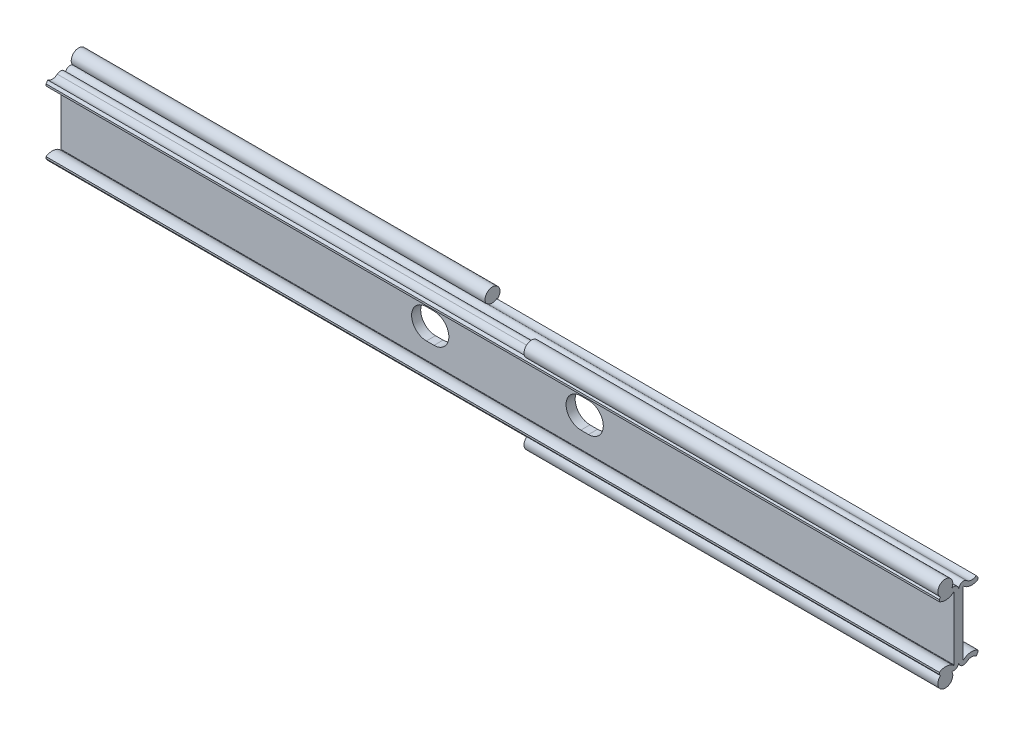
ISO-10303-21;
HEADER;
FILE_DESCRIPTION(('STEP AP214'),'2;1');
FILE_NAME('part.step','',(''),(''),'','','');
FILE_SCHEMA(('AUTOMOTIVE_DESIGN { 1 0 10303 214 1 1 1 1 }'));
ENDSEC;
DATA;
#1=APPLICATION_CONTEXT('core data for automotive mechanical design processes');
#2=APPLICATION_PROTOCOL_DEFINITION('international standard','automotive_design',2000,#1);
#3=PRODUCT_CONTEXT('',#1,'mechanical');
#4=PRODUCT('Part','Part','',(#3));
#5=PRODUCT_RELATED_PRODUCT_CATEGORY('part','',(#4));
#6=PRODUCT_DEFINITION_FORMATION('','',#4);
#7=PRODUCT_DEFINITION_CONTEXT('part definition',#1,'design');
#8=PRODUCT_DEFINITION('design','',#6,#7);
#9=PRODUCT_DEFINITION_SHAPE('','',#8);
#10=(LENGTH_UNIT() NAMED_UNIT(*) SI_UNIT(.MILLI.,.METRE.));
#11=(NAMED_UNIT(*) PLANE_ANGLE_UNIT() SI_UNIT($,.RADIAN.));
#12=(NAMED_UNIT(*) SI_UNIT($,.STERADIAN.) SOLID_ANGLE_UNIT());
#13=UNCERTAINTY_MEASURE_WITH_UNIT(LENGTH_MEASURE(1.E-05),#10,'distance_accuracy_value','');
#14=(GEOMETRIC_REPRESENTATION_CONTEXT(3) GLOBAL_UNCERTAINTY_ASSIGNED_CONTEXT((#13)) GLOBAL_UNIT_ASSIGNED_CONTEXT((#10,
#11,#12)) REPRESENTATION_CONTEXT('',''));
#15=CARTESIAN_POINT('',(0.,0.,0.));
#16=DIRECTION('',(0.,0.,1.));
#17=DIRECTION('',(1.,0.,0.));
#18=AXIS2_PLACEMENT_3D('',#15,#16,#17);
#19=CARTESIAN_POINT('',(-152.4,13.9149993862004,-4.44999974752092));
#20=DIRECTION('',(1.,0.,0.));
#21=DIRECTION('',(0.,0.,-1.));
#22=AXIS2_PLACEMENT_3D('',#19,#20,#21);
#23=CYLINDRICAL_SURFACE('',#22,2.54999999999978);
#24=CARTESIAN_POINT('',(-11.2,13.9149993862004,-4.44999974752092));
#25=DIRECTION('',(-1.,0.,0.));
#26=DIRECTION('',(0.,0.,1.));
#27=AXIS2_PLACEMENT_3D('',#24,#25,#26);
#28=CIRCLE('',#27,2.54999999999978);
#29=CARTESIAN_POINT('',(-11.2,12.0059660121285,-2.75941062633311));
#30=VERTEX_POINT('',#29);
#31=CARTESIAN_POINT('',(-11.2,11.8784793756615,-5.98462877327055));
#32=VERTEX_POINT('',#31);
#33=EDGE_CURVE('E317',#30,#32,#28,.F.);
#34=ORIENTED_EDGE('',*,*,#33,.F.);
#35=DIRECTION('',(1.,0.,0.));
#36=VECTOR('',#35,1.);
#37=CARTESIAN_POINT('',(-152.4,12.0059660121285,-2.75941062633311));
#38=LINE('',#37,#36);
#39=CARTESIAN_POINT('',(152.4,12.0059660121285,-2.75941062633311));
#40=VERTEX_POINT('',#39);
#41=EDGE_CURVE('E536',#30,#40,#38,.T.);
#42=ORIENTED_EDGE('',*,*,#41,.T.);
#43=CARTESIAN_POINT('',(152.4,13.9149993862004,-4.44999974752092));
#44=DIRECTION('',(1.,0.,0.));
#45=DIRECTION('',(0.,0.,-1.));
#46=AXIS2_PLACEMENT_3D('',#43,#44,#45);
#47=CIRCLE('',#46,2.54999999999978);
#48=CARTESIAN_POINT('',(152.4,11.8784793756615,-5.98462877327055));
#49=VERTEX_POINT('',#48);
#50=EDGE_CURVE('E453',#40,#49,#47,.T.);
#51=ORIENTED_EDGE('',*,*,#50,.T.);
#52=DIRECTION('',(1.,0.,0.));
#53=VECTOR('',#52,1.);
#54=CARTESIAN_POINT('',(-152.4,11.8784793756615,-5.98462877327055));
#55=LINE('',#54,#53);
#56=EDGE_CURVE('E534',#32,#49,#55,.T.);
#57=ORIENTED_EDGE('',*,*,#56,.F.);
#58=EDGE_LOOP('',(#34,#42,#51,#57));
#59=FACE_BOUND('',#58,.T.);
#60=ADVANCED_FACE('F14',(#59),#23,.F.);
#61=CARTESIAN_POINT('',(-152.4,13.9149993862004,4.44999974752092));
#62=DIRECTION('',(1.,0.,0.));
#63=DIRECTION('',(0.,0.,-1.));
#64=AXIS2_PLACEMENT_3D('',#61,#62,#63);
#65=CYLINDRICAL_SURFACE('',#64,2.54999999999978);
#66=CARTESIAN_POINT('',(11.2,13.9149993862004,4.44999974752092));
#67=DIRECTION('',(1.,0.,0.));
#68=DIRECTION('',(0.,0.,-1.));
#69=AXIS2_PLACEMENT_3D('',#66,#67,#68);
#70=CIRCLE('',#69,2.54999999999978);
#71=CARTESIAN_POINT('',(11.2,12.0059660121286,2.75941062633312));
#72=VERTEX_POINT('',#71);
#73=CARTESIAN_POINT('',(11.2,11.8784793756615,5.98462877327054));
#74=VERTEX_POINT('',#73);
#75=EDGE_CURVE('E347',#72,#74,#70,.F.);
#76=ORIENTED_EDGE('',*,*,#75,.F.);
#77=DIRECTION('',(1.,0.,0.));
#78=VECTOR('',#77,1.);
#79=CARTESIAN_POINT('',(-152.4,12.0059660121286,2.75941062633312));
#80=LINE('',#79,#78);
#81=CARTESIAN_POINT('',(-152.4,12.0059660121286,2.75941062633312));
#82=VERTEX_POINT('',#81);
#83=EDGE_CURVE('E541',#82,#72,#80,.T.);
#84=ORIENTED_EDGE('',*,*,#83,.F.);
#85=CARTESIAN_POINT('',(-152.4,13.9149993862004,4.44999974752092));
#86=DIRECTION('',(1.,0.,0.));
#87=DIRECTION('',(0.,0.,1.));
#88=AXIS2_PLACEMENT_3D('',#85,#86,#87);
#89=CIRCLE('',#88,2.54999999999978);
#90=CARTESIAN_POINT('',(-152.4,11.8784793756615,5.98462877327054));
#91=VERTEX_POINT('',#90);
#92=EDGE_CURVE('E498',#91,#82,#89,.T.);
#93=ORIENTED_EDGE('',*,*,#92,.F.);
#94=DIRECTION('',(1.,0.,0.));
#95=VECTOR('',#94,1.);
#96=CARTESIAN_POINT('',(-152.4,11.8784793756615,5.98462877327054));
#97=LINE('',#96,#95);
#98=EDGE_CURVE('E544',#91,#74,#97,.T.);
#99=ORIENTED_EDGE('',*,*,#98,.T.);
#100=EDGE_LOOP('',(#76,#84,#93,#99));
#101=FACE_BOUND('',#100,.T.);
#102=ADVANCED_FACE('F718',(#101),#65,.F.);
#103=CARTESIAN_POINT('',(-152.4,-13.9149993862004,-4.44999974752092));
#104=DIRECTION('',(1.,0.,0.));
#105=DIRECTION('',(0.,0.,-1.));
#106=AXIS2_PLACEMENT_3D('',#103,#104,#105);
#107=CYLINDRICAL_SURFACE('',#106,4.09999984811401);
#108=CARTESIAN_POINT('',(152.4,-13.9149993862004,-4.44999974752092));
#109=DIRECTION('',(-1.,0.,0.));
#110=DIRECTION('',(0.,0.,-1.));
#111=AXIS2_PLACEMENT_3D('',#108,#109,#110);
#112=CIRCLE('',#111,4.09999984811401);
#113=CARTESIAN_POINT('',(152.4,-10.8444021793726,-1.73312073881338));
#114=VERTEX_POINT('',#113);
#115=CARTESIAN_POINT('',(152.4,-10.4239395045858,-6.59999966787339));
#116=VERTEX_POINT('',#115);
#117=EDGE_CURVE('E415',#114,#116,#112,.T.);
#118=ORIENTED_EDGE('',*,*,#117,.T.);
#119=DIRECTION('',(1.,0.,0.));
#120=VECTOR('',#119,1.);
#121=CARTESIAN_POINT('',(-152.4,-10.4239395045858,-6.59999966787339));
#122=LINE('',#121,#120);
#123=CARTESIAN_POINT('',(-152.4,-10.4239395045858,-6.59999966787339));
#124=VERTEX_POINT('',#123);
#125=EDGE_CURVE('E587',#124,#116,#122,.T.);
#126=ORIENTED_EDGE('',*,*,#125,.F.);
#127=CARTESIAN_POINT('',(-152.4,-13.9149993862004,-4.44999974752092));
#128=DIRECTION('',(-1.,0.,0.));
#129=DIRECTION('',(0.,0.,-1.));
#130=AXIS2_PLACEMENT_3D('',#127,#128,#129);
#131=CIRCLE('',#130,4.09999984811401);
#132=CARTESIAN_POINT('',(-152.4,-10.8444021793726,-1.73312073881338));
#133=VERTEX_POINT('',#132);
#134=EDGE_CURVE('E468',#133,#124,#131,.T.);
#135=ORIENTED_EDGE('',*,*,#134,.F.);
#136=DIRECTION('',(1.,0.,0.));
#137=VECTOR('',#136,1.);
#138=CARTESIAN_POINT('',(-152.4,-10.8444021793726,-1.73312073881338));
#139=LINE('',#138,#137);
#140=EDGE_CURVE('E516',#133,#114,#139,.T.);
#141=ORIENTED_EDGE('',*,*,#140,.T.);
#142=EDGE_LOOP('',(#118,#126,#135,#141));
#143=FACE_BOUND('',#142,.T.);
#144=ADVANCED_FACE('F16',(#143),#107,.T.);
#145=CARTESIAN_POINT('',(-152.4,-11.0618535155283,-6.59999966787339));
#146=DIRECTION('',(0.,0.,1.));
#147=DIRECTION('',(1.,0.,0.));
#148=AXIS2_PLACEMENT_3D('',#145,#146,#147);
#149=PLANE('',#148);
#150=DIRECTION('',(0.,-1.,0.));
#151=VECTOR('',#150,1.);
#152=CARTESIAN_POINT('',(152.4,-11.0618535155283,-6.59999966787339));
#153=LINE('',#152,#151);
#154=CARTESIAN_POINT('',(152.4,-11.0618535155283,-6.59999966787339));
#155=VERTEX_POINT('',#154);
#156=EDGE_CURVE('E418',#116,#155,#153,.T.);
#157=ORIENTED_EDGE('',*,*,#156,.T.);
#158=DIRECTION('',(1.,0.,0.));
#159=VECTOR('',#158,1.);
#160=CARTESIAN_POINT('',(-152.4,-11.0618535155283,-6.59999966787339));
#161=LINE('',#160,#159);
#162=CARTESIAN_POINT('',(-152.4,-11.0618535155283,-6.59999966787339));
#163=VERTEX_POINT('',#162);
#164=EDGE_CURVE('E584',#163,#155,#161,.T.);
#165=ORIENTED_EDGE('',*,*,#164,.F.);
#166=DIRECTION('',(0.,-1.,0.));
#167=VECTOR('',#166,1.);
#168=CARTESIAN_POINT('',(-152.4,-11.0618535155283,-6.59999966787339));
#169=LINE('',#168,#167);
#170=EDGE_CURVE('E471',#124,#163,#169,.T.);
#171=ORIENTED_EDGE('',*,*,#170,.F.);
#172=ORIENTED_EDGE('',*,*,#125,.T.);
#173=EDGE_LOOP('',(#157,#165,#171,#172));
#174=FACE_BOUND('',#173,.T.);
#175=ADVANCED_FACE('F640',(#174),#149,.F.);
#176=CARTESIAN_POINT('',(-152.4,-11.8784793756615,-5.98462877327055));
#177=DIRECTION('',(0.,0.601814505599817,0.79863590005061));
#178=DIRECTION('',(0.,0.79863590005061,-0.601814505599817));
#179=AXIS2_PLACEMENT_3D('',#176,#177,#178);
#180=PLANE('',#179);
#181=DIRECTION('',(0.,0.79863590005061,-0.601814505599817));
#182=VECTOR('',#181,1.);
#183=CARTESIAN_POINT('',(-11.2,-11.8784793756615,-5.98462877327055));
#184=LINE('',#183,#182);
#185=CARTESIAN_POINT('',(-11.2,-11.8784793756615,-5.98462877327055));
#186=VERTEX_POINT('',#185);
#187=CARTESIAN_POINT('',(-11.2,-11.6159967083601,-6.18242338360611));
#188=VERTEX_POINT('',#187);
#189=EDGE_CURVE('E305',#186,#188,#184,.T.);
#190=ORIENTED_EDGE('',*,*,#189,.T.);
#191=DIRECTION('',(-1.,0.,0.));
#192=VECTOR('',#191,1.);
#193=CARTESIAN_POINT('',(-11.2,-11.6159967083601,-6.18242338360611));
#194=LINE('',#193,#192);
#195=CARTESIAN_POINT('',(-152.4,-11.6159967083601,-6.18242338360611));
#196=VERTEX_POINT('',#195);
#197=EDGE_CURVE('E295',#188,#196,#194,.T.);
#198=ORIENTED_EDGE('',*,*,#197,.T.);
#199=DIRECTION('',(0.,-0.79863590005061,0.601814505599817));
#200=VECTOR('',#199,1.);
#201=CARTESIAN_POINT('',(-152.4,-11.8784793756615,-5.98462877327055));
#202=LINE('',#201,#200);
#203=EDGE_CURVE('E473',#163,#196,#202,.T.);
#204=ORIENTED_EDGE('',*,*,#203,.F.);
#205=ORIENTED_EDGE('',*,*,#164,.T.);
#206=DIRECTION('',(0.,-0.79863590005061,0.601814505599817));
#207=VECTOR('',#206,1.);
#208=CARTESIAN_POINT('',(152.4,-11.8784793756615,-5.98462877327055));
#209=LINE('',#208,#207);
#210=CARTESIAN_POINT('',(152.4,-11.8784793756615,-5.98462877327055));
#211=VERTEX_POINT('',#210);
#212=EDGE_CURVE('E420',#155,#211,#209,.T.);
#213=ORIENTED_EDGE('',*,*,#212,.T.);
#214=DIRECTION('',(1.,0.,0.));
#215=VECTOR('',#214,1.);
#216=CARTESIAN_POINT('',(-152.4,-11.8784793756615,-5.98462877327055));
#217=LINE('',#216,#215);
#218=EDGE_CURVE('E582',#186,#211,#217,.T.);
#219=ORIENTED_EDGE('',*,*,#218,.F.);
#220=EDGE_LOOP('',(#190,#198,#204,#205,#213,#219));
#221=FACE_BOUND('',#220,.T.);
#222=ADVANCED_FACE('F643',(#221),#180,.F.);
#223=CARTESIAN_POINT('',(-152.4,-13.9149993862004,-4.44999974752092));
#224=DIRECTION('',(1.,0.,0.));
#225=DIRECTION('',(0.,0.,-1.));
#226=AXIS2_PLACEMENT_3D('',#223,#224,#225);
#227=CYLINDRICAL_SURFACE('',#226,2.54999999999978);
#228=DIRECTION('',(1.,0.,0.));
#229=VECTOR('',#228,1.);
#230=CARTESIAN_POINT('',(-152.4,-12.0059660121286,-2.75941062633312));
#231=LINE('',#230,#229);
#232=CARTESIAN_POINT('',(-11.2,-12.0059660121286,-2.75941062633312));
#233=VERTEX_POINT('',#232);
#234=CARTESIAN_POINT('',(152.4,-12.0059660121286,-2.75941062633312));
#235=VERTEX_POINT('',#234);
#236=EDGE_CURVE('E580',#233,#235,#231,.T.);
#237=ORIENTED_EDGE('',*,*,#236,.F.);
#238=CARTESIAN_POINT('',(-11.2,-13.9149993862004,-4.44999974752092));
#239=DIRECTION('',(1.,0.,0.));
#240=DIRECTION('',(0.,0.,-1.));
#241=AXIS2_PLACEMENT_3D('',#238,#239,#240);
#242=CIRCLE('',#241,2.54999999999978);
#243=EDGE_CURVE('E286',#233,#186,#242,.F.);
#244=ORIENTED_EDGE('',*,*,#243,.T.);
#245=ORIENTED_EDGE('',*,*,#218,.T.);
#246=CARTESIAN_POINT('',(152.4,-13.9149993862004,-4.44999974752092));
#247=DIRECTION('',(1.,0.,0.));
#248=DIRECTION('',(0.,0.,1.));
#249=AXIS2_PLACEMENT_3D('',#246,#247,#248);
#250=CIRCLE('',#249,2.54999999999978);
#251=EDGE_CURVE('E423',#211,#235,#250,.T.);
#252=ORIENTED_EDGE('',*,*,#251,.T.);
#253=EDGE_LOOP('',(#237,#244,#245,#252));
#254=FACE_BOUND('',#253,.T.);
#255=ADVANCED_FACE('F646',(#254),#227,.F.);
#256=CARTESIAN_POINT('',(-152.4,-10.7622235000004,-1.65999984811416));
#257=DIRECTION('',(1.,0.,0.));
#258=DIRECTION('',(0.,0.,-1.));
#259=AXIS2_PLACEMENT_3D('',#256,#257,#258);
#260=CYLINDRICAL_SURFACE('',#259,1.65999984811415);
#261=CARTESIAN_POINT('',(-152.4,-10.7622235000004,-1.65999984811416));
#262=DIRECTION('',(-1.,0.,0.));
#263=DIRECTION('',(0.,0.,-1.));
#264=AXIS2_PLACEMENT_3D('',#261,#262,#263);
#265=CIRCLE('',#264,1.65999984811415);
#266=CARTESIAN_POINT('',(-152.4,-12.2669165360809,-2.36106929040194));
#267=VERTEX_POINT('',#266);
#268=CARTESIAN_POINT('',(-152.4,-10.7622235,0.));
#269=VERTEX_POINT('',#268);
#270=EDGE_CURVE('E299',#267,#269,#265,.T.);
#271=ORIENTED_EDGE('',*,*,#270,.F.);
#272=DIRECTION('',(-1.,0.,0.));
#273=VECTOR('',#272,1.);
#274=CARTESIAN_POINT('',(-81.8,-12.2669165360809,-2.36106929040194));
#275=LINE('',#274,#273);
#276=CARTESIAN_POINT('',(-11.2,-12.2669165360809,-2.36106929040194));
#277=VERTEX_POINT('',#276);
#278=EDGE_CURVE('E292',#267,#277,#275,.F.);
#279=ORIENTED_EDGE('',*,*,#278,.T.);
#280=CARTESIAN_POINT('',(-11.2,-10.7622235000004,-1.65999984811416));
#281=DIRECTION('',(1.,0.,0.));
#282=DIRECTION('',(0.,0.,-1.));
#283=AXIS2_PLACEMENT_3D('',#280,#281,#282);
#284=CIRCLE('',#283,1.65999984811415);
#285=EDGE_CURVE('E9',#277,#233,#284,.T.);
#286=ORIENTED_EDGE('',*,*,#285,.T.);
#287=ORIENTED_EDGE('',*,*,#236,.T.);
#288=CARTESIAN_POINT('',(152.4,-10.7622235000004,-1.65999984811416));
#289=DIRECTION('',(-1.,0.,0.));
#290=DIRECTION('',(0.,0.,-1.));
#291=AXIS2_PLACEMENT_3D('',#288,#289,#290);
#292=CIRCLE('',#291,1.65999984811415);
#293=CARTESIAN_POINT('',(152.4,-10.7622235,0.));
#294=VERTEX_POINT('',#293);
#295=EDGE_CURVE('E426',#235,#294,#292,.T.);
#296=ORIENTED_EDGE('',*,*,#295,.T.);
#297=DIRECTION('',(1.,0.,0.));
#298=VECTOR('',#297,1.);
#299=CARTESIAN_POINT('',(-152.4,-10.7622235,0.));
#300=LINE('',#299,#298);
#301=EDGE_CURVE('E577',#269,#294,#300,.T.);
#302=ORIENTED_EDGE('',*,*,#301,.F.);
#303=EDGE_LOOP('',(#271,#279,#286,#287,#296,#302));
#304=FACE_BOUND('',#303,.T.);
#305=ADVANCED_FACE('F297',(#304),#260,.T.);
#306=CARTESIAN_POINT('',(-152.4,-10.7622235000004,1.65999984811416));
#307=DIRECTION('',(1.,0.,0.));
#308=DIRECTION('',(0.,0.,-1.));
#309=AXIS2_PLACEMENT_3D('',#306,#307,#308);
#310=CYLINDRICAL_SURFACE('',#309,1.65999984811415);
#311=CARTESIAN_POINT('',(152.4,-10.7622235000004,1.65999984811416));
#312=DIRECTION('',(-1.,0.,0.));
#313=DIRECTION('',(0.,0.,1.));
#314=AXIS2_PLACEMENT_3D('',#311,#312,#313);
#315=CIRCLE('',#314,1.65999984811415);
#316=CARTESIAN_POINT('',(152.4,-12.2669165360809,2.36106929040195));
#317=VERTEX_POINT('',#316);
#318=EDGE_CURVE('E428',#294,#317,#315,.T.);
#319=ORIENTED_EDGE('',*,*,#318,.T.);
#320=DIRECTION('',(1.,0.,0.));
#321=VECTOR('',#320,1.);
#322=CARTESIAN_POINT('',(81.8,-12.2669165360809,2.36106929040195));
#323=LINE('',#322,#321);
#324=CARTESIAN_POINT('',(11.2,-12.2669165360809,2.36106929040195));
#325=VERTEX_POINT('',#324);
#326=EDGE_CURVE('E330',#317,#325,#323,.F.);
#327=ORIENTED_EDGE('',*,*,#326,.T.);
#328=CARTESIAN_POINT('',(11.2,-10.7622235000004,1.65999984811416));
#329=DIRECTION('',(-1.,0.,0.));
#330=DIRECTION('',(0.,0.,1.));
#331=AXIS2_PLACEMENT_3D('',#328,#329,#330);
#332=CIRCLE('',#331,1.65999984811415);
#333=CARTESIAN_POINT('',(11.2,-12.0059660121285,2.75941062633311));
#334=VERTEX_POINT('',#333);
#335=EDGE_CURVE('E334',#325,#334,#332,.T.);
#336=ORIENTED_EDGE('',*,*,#335,.T.);
#337=DIRECTION('',(1.,0.,0.));
#338=VECTOR('',#337,1.);
#339=CARTESIAN_POINT('',(-152.4,-12.0059660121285,2.75941062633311));
#340=LINE('',#339,#338);
#341=CARTESIAN_POINT('',(-152.4,-12.0059660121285,2.75941062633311));
#342=VERTEX_POINT('',#341);
#343=EDGE_CURVE('E574',#342,#334,#340,.T.);
#344=ORIENTED_EDGE('',*,*,#343,.F.);
#345=CARTESIAN_POINT('',(-152.4,-10.7622235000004,1.65999984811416));
#346=DIRECTION('',(-1.,0.,0.));
#347=DIRECTION('',(0.,0.,1.));
#348=AXIS2_PLACEMENT_3D('',#345,#346,#347);
#349=CIRCLE('',#348,1.65999984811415);
#350=EDGE_CURVE('E476',#269,#342,#349,.T.);
#351=ORIENTED_EDGE('',*,*,#350,.F.);
#352=ORIENTED_EDGE('',*,*,#301,.T.);
#353=EDGE_LOOP('',(#319,#327,#336,#344,#351,#352));
#354=FACE_BOUND('',#353,.T.);
#355=ADVANCED_FACE('F653',(#354),#310,.T.);
#356=CARTESIAN_POINT('',(-152.4,-13.9149993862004,4.44999974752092));
#357=DIRECTION('',(1.,0.,0.));
#358=DIRECTION('',(0.,0.,-1.));
#359=AXIS2_PLACEMENT_3D('',#356,#357,#358);
#360=CYLINDRICAL_SURFACE('',#359,2.54999999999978);
#361=ORIENTED_EDGE('',*,*,#343,.T.);
#362=CARTESIAN_POINT('',(11.2,-13.9149993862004,4.44999974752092));
#363=DIRECTION('',(-1.,0.,0.));
#364=DIRECTION('',(0.,0.,1.));
#365=AXIS2_PLACEMENT_3D('',#362,#363,#364);
#366=CIRCLE('',#365,2.54999999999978);
#367=CARTESIAN_POINT('',(11.2,-11.8784793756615,5.98462877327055));
#368=VERTEX_POINT('',#367);
#369=EDGE_CURVE('E332',#334,#368,#366,.F.);
#370=ORIENTED_EDGE('',*,*,#369,.T.);
#371=DIRECTION('',(1.,0.,0.));
#372=VECTOR('',#371,1.);
#373=CARTESIAN_POINT('',(-152.4,-11.8784793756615,5.98462877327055));
#374=LINE('',#373,#372);
#375=CARTESIAN_POINT('',(-152.4,-11.8784793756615,5.98462877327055));
#376=VERTEX_POINT('',#375);
#377=EDGE_CURVE('E571',#376,#368,#374,.T.);
#378=ORIENTED_EDGE('',*,*,#377,.F.);
#379=CARTESIAN_POINT('',(-152.4,-13.9149993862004,4.44999974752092));
#380=DIRECTION('',(1.,0.,0.));
#381=DIRECTION('',(0.,0.,-1.));
#382=AXIS2_PLACEMENT_3D('',#379,#380,#381);
#383=CIRCLE('',#382,2.54999999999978);
#384=EDGE_CURVE('E478',#342,#376,#383,.T.);
#385=ORIENTED_EDGE('',*,*,#384,.F.);
#386=EDGE_LOOP('',(#361,#370,#378,#385));
#387=FACE_BOUND('',#386,.T.);
#388=ADVANCED_FACE('F670',(#387),#360,.F.);
#389=CARTESIAN_POINT('',(-152.4,-11.8784793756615,5.98462877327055));
#390=DIRECTION('',(0.,0.601814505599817,-0.79863590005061));
#391=DIRECTION('',(0.,-0.79863590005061,-0.601814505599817));
#392=AXIS2_PLACEMENT_3D('',#389,#390,#391);
#393=PLANE('',#392);
#394=DIRECTION('',(0.,0.79863590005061,0.601814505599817));
#395=VECTOR('',#394,1.);
#396=CARTESIAN_POINT('',(11.2,-11.8784793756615,5.98462877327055));
#397=LINE('',#396,#395);
#398=CARTESIAN_POINT('',(11.2,-11.6159967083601,6.18242338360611));
#399=VERTEX_POINT('',#398);
#400=EDGE_CURVE('E593',#368,#399,#397,.T.);
#401=ORIENTED_EDGE('',*,*,#400,.T.);
#402=DIRECTION('',(1.,0.,0.));
#403=VECTOR('',#402,1.);
#404=CARTESIAN_POINT('',(11.2,-11.6159967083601,6.18242338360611));
#405=LINE('',#404,#403);
#406=CARTESIAN_POINT('',(152.4,-11.6159967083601,6.18242338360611));
#407=VERTEX_POINT('',#406);
#408=EDGE_CURVE('E325',#399,#407,#405,.T.);
#409=ORIENTED_EDGE('',*,*,#408,.T.);
#410=DIRECTION('',(0.,0.79863590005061,0.601814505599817));
#411=VECTOR('',#410,1.);
#412=CARTESIAN_POINT('',(152.4,-11.8784793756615,5.98462877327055));
#413=LINE('',#412,#411);
#414=CARTESIAN_POINT('',(152.4,-11.0618535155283,6.59999966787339));
#415=VERTEX_POINT('',#414);
#416=EDGE_CURVE('E430',#407,#415,#413,.T.);
#417=ORIENTED_EDGE('',*,*,#416,.T.);
#418=DIRECTION('',(1.,0.,0.));
#419=VECTOR('',#418,1.);
#420=CARTESIAN_POINT('',(-152.4,-11.0618535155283,6.59999966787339));
#421=LINE('',#420,#419);
#422=CARTESIAN_POINT('',(-152.4,-11.0618535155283,6.59999966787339));
#423=VERTEX_POINT('',#422);
#424=EDGE_CURVE('E568',#423,#415,#421,.T.);
#425=ORIENTED_EDGE('',*,*,#424,.F.);
#426=DIRECTION('',(0.,0.79863590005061,0.601814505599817));
#427=VECTOR('',#426,1.);
#428=CARTESIAN_POINT('',(-152.4,-11.8784793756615,5.98462877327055));
#429=LINE('',#428,#427);
#430=EDGE_CURVE('E480',#376,#423,#429,.T.);
#431=ORIENTED_EDGE('',*,*,#430,.F.);
#432=ORIENTED_EDGE('',*,*,#377,.T.);
#433=EDGE_LOOP('',(#401,#409,#417,#425,#431,#432));
#434=FACE_BOUND('',#433,.T.);
#435=ADVANCED_FACE('F674',(#434),#393,.F.);
#436=CARTESIAN_POINT('',(-152.4,-11.0618535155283,6.59999966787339));
#437=DIRECTION('',(0.,0.,-1.));
#438=DIRECTION('',(-1.,0.,0.));
#439=AXIS2_PLACEMENT_3D('',#436,#437,#438);
#440=PLANE('',#439);
#441=DIRECTION('',(0.,1.,0.));
#442=VECTOR('',#441,1.);
#443=CARTESIAN_POINT('',(152.4,-11.0618535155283,6.59999966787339));
#444=LINE('',#443,#442);
#445=CARTESIAN_POINT('',(152.4,-10.4239395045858,6.59999966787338));
#446=VERTEX_POINT('',#445);
#447=EDGE_CURVE('E432',#415,#446,#444,.T.);
#448=ORIENTED_EDGE('',*,*,#447,.T.);
#449=DIRECTION('',(1.,0.,0.));
#450=VECTOR('',#449,1.);
#451=CARTESIAN_POINT('',(-152.4,-10.4239395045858,6.59999966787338));
#452=LINE('',#451,#450);
#453=CARTESIAN_POINT('',(-152.4,-10.4239395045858,6.59999966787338));
#454=VERTEX_POINT('',#453);
#455=EDGE_CURVE('E565',#454,#446,#452,.T.);
#456=ORIENTED_EDGE('',*,*,#455,.F.);
#457=DIRECTION('',(0.,1.,0.));
#458=VECTOR('',#457,1.);
#459=CARTESIAN_POINT('',(-152.4,-11.0618535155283,6.59999966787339));
#460=LINE('',#459,#458);
#461=EDGE_CURVE('E482',#423,#454,#460,.T.);
#462=ORIENTED_EDGE('',*,*,#461,.F.);
#463=ORIENTED_EDGE('',*,*,#424,.T.);
#464=EDGE_LOOP('',(#448,#456,#462,#463));
#465=FACE_BOUND('',#464,.T.);
#466=ADVANCED_FACE('F681',(#465),#440,.F.);
#467=CARTESIAN_POINT('',(-152.4,-13.9149993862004,4.44999974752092));
#468=DIRECTION('',(1.,0.,0.));
#469=DIRECTION('',(0.,0.,-1.));
#470=AXIS2_PLACEMENT_3D('',#467,#468,#469);
#471=CYLINDRICAL_SURFACE('',#470,4.09999984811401);
#472=CARTESIAN_POINT('',(152.4,-13.9149993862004,4.44999974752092));
#473=DIRECTION('',(-1.,0.,0.));
#474=DIRECTION('',(0.,0.,1.));
#475=AXIS2_PLACEMENT_3D('',#472,#473,#474);
#476=CIRCLE('',#475,4.09999984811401);
#477=CARTESIAN_POINT('',(152.4,-10.8444021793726,1.73312073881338));
#478=VERTEX_POINT('',#477);
#479=EDGE_CURVE('E434',#446,#478,#476,.T.);
#480=ORIENTED_EDGE('',*,*,#479,.T.);
#481=DIRECTION('',(1.,0.,0.));
#482=VECTOR('',#481,1.);
#483=CARTESIAN_POINT('',(-152.4,-10.8444021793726,1.73312073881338));
#484=LINE('',#483,#482);
#485=CARTESIAN_POINT('',(-152.4,-10.8444021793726,1.73312073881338));
#486=VERTEX_POINT('',#485);
#487=EDGE_CURVE('E562',#486,#478,#484,.T.);
#488=ORIENTED_EDGE('',*,*,#487,.F.);
#489=CARTESIAN_POINT('',(-152.4,-13.9149993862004,4.44999974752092));
#490=DIRECTION('',(-1.,0.,0.));
#491=DIRECTION('',(0.,0.,1.));
#492=AXIS2_PLACEMENT_3D('',#489,#490,#491);
#493=CIRCLE('',#492,4.09999984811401);
#494=EDGE_CURVE('E484',#454,#486,#493,.T.);
#495=ORIENTED_EDGE('',*,*,#494,.F.);
#496=ORIENTED_EDGE('',*,*,#455,.T.);
#497=EDGE_LOOP('',(#480,#488,#495,#496));
#498=FACE_BOUND('',#497,.T.);
#499=ADVANCED_FACE('F684',(#498),#471,.T.);
#500=CARTESIAN_POINT('',(-152.4,-10.7622235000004,1.65999984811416));
#501=DIRECTION('',(1.,0.,0.));
#502=DIRECTION('',(0.,0.,-1.));
#503=AXIS2_PLACEMENT_3D('',#500,#501,#502);
#504=CYLINDRICAL_SURFACE('',#503,0.110000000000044);
#505=CARTESIAN_POINT('',(152.4,-10.7622235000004,1.65999984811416));
#506=DIRECTION('',(1.,0.,0.));
#507=DIRECTION('',(0.,0.,-1.));
#508=AXIS2_PLACEMENT_3D('',#505,#506,#507);
#509=CIRCLE('',#508,0.110000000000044);
#510=CARTESIAN_POINT('',(152.4,-10.7622235,1.5499998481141));
#511=VERTEX_POINT('',#510);
#512=EDGE_CURVE('E436',#478,#511,#509,.T.);
#513=ORIENTED_EDGE('',*,*,#512,.T.);
#514=DIRECTION('',(1.,0.,0.));
#515=VECTOR('',#514,1.);
#516=CARTESIAN_POINT('',(-152.4,-10.7622235,1.5499998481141));
#517=LINE('',#516,#515);
#518=CARTESIAN_POINT('',(-152.4,-10.7622235,1.5499998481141));
#519=VERTEX_POINT('',#518);
#520=EDGE_CURVE('E559',#519,#511,#517,.T.);
#521=ORIENTED_EDGE('',*,*,#520,.F.);
#522=CARTESIAN_POINT('',(-152.4,-10.7622235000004,1.65999984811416));
#523=DIRECTION('',(1.,0.,0.));
#524=DIRECTION('',(0.,0.,-1.));
#525=AXIS2_PLACEMENT_3D('',#522,#523,#524);
#526=CIRCLE('',#525,0.110000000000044);
#527=EDGE_CURVE('E486',#486,#519,#526,.T.);
#528=ORIENTED_EDGE('',*,*,#527,.F.);
#529=ORIENTED_EDGE('',*,*,#487,.T.);
#530=EDGE_LOOP('',(#513,#521,#528,#529));
#531=FACE_BOUND('',#530,.T.);
#532=ADVANCED_FACE('F689',(#531),#504,.F.);
#533=CARTESIAN_POINT('',(-152.4,10.7622235,1.5499998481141));
#534=DIRECTION('',(0.,0.,-1.));
#535=DIRECTION('',(-1.,0.,0.));
#536=AXIS2_PLACEMENT_3D('',#533,#534,#535);
#537=PLANE('',#536);
#538=DIRECTION('',(1.,0.,0.));
#539=VECTOR('',#538,1.);
#540=CARTESIAN_POINT('',(27.65,-5.05,1.5499998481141));
#541=LINE('',#540,#539);
#542=CARTESIAN_POINT('',(25.05,-5.05,1.5499998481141));
#543=VERTEX_POINT('',#542);
#544=CARTESIAN_POINT('',(27.65,-5.05,1.5499998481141));
#545=VERTEX_POINT('',#544);
#546=EDGE_CURVE('E363',#543,#545,#541,.T.);
#547=ORIENTED_EDGE('',*,*,#546,.F.);
#548=CARTESIAN_POINT('',(25.05,0.,1.5499998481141));
#549=DIRECTION('',(0.,0.,1.));
#550=DIRECTION('',(1.,0.,0.));
#551=AXIS2_PLACEMENT_3D('',#548,#549,#550);
#552=CIRCLE('',#551,5.05);
#553=CARTESIAN_POINT('',(25.05,5.05,1.5499998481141));
#554=VERTEX_POINT('',#553);
#555=EDGE_CURVE('E361',#554,#543,#552,.T.);
#556=ORIENTED_EDGE('',*,*,#555,.F.);
#557=DIRECTION('',(-1.,0.,0.));
#558=VECTOR('',#557,1.);
#559=CARTESIAN_POINT('',(25.05,5.05,1.5499998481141));
#560=LINE('',#559,#558);
#561=CARTESIAN_POINT('',(27.65,5.05,1.5499998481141));
#562=VERTEX_POINT('',#561);
#563=EDGE_CURVE('E369',#562,#554,#560,.T.);
#564=ORIENTED_EDGE('',*,*,#563,.F.);
#565=CARTESIAN_POINT('',(27.65,0.,1.5499998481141));
#566=DIRECTION('',(0.,0.,1.));
#567=DIRECTION('',(1.,0.,0.));
#568=AXIS2_PLACEMENT_3D('',#565,#566,#567);
#569=CIRCLE('',#568,5.05);
#570=EDGE_CURVE('E366',#545,#562,#569,.T.);
#571=ORIENTED_EDGE('',*,*,#570,.F.);
#572=EDGE_LOOP('',(#547,#556,#564,#571));
#573=FACE_BOUND('',#572,.T.);
#574=DIRECTION('',(1.,0.,0.));
#575=VECTOR('',#574,1.);
#576=CARTESIAN_POINT('',(-27.65,-5.05,1.5499998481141));
#577=LINE('',#576,#575);
#578=CARTESIAN_POINT('',(-27.65,-5.05,1.5499998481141));
#579=VERTEX_POINT('',#578);
#580=CARTESIAN_POINT('',(-25.05,-5.05,1.5499998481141));
#581=VERTEX_POINT('',#580);
#582=EDGE_CURVE('E394',#579,#581,#577,.T.);
#583=ORIENTED_EDGE('',*,*,#582,.F.);
#584=CARTESIAN_POINT('',(-27.65,0.,1.5499998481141));
#585=DIRECTION('',(0.,0.,1.));
#586=DIRECTION('',(-1.,0.,0.));
#587=AXIS2_PLACEMENT_3D('',#584,#585,#586);
#588=CIRCLE('',#587,5.05);
#589=CARTESIAN_POINT('',(-27.65,5.05,1.5499998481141));
#590=VERTEX_POINT('',#589);
#591=EDGE_CURVE('E392',#590,#579,#588,.T.);
#592=ORIENTED_EDGE('',*,*,#591,.F.);
#593=DIRECTION('',(-1.,0.,0.));
#594=VECTOR('',#593,1.);
#595=CARTESIAN_POINT('',(-25.05,5.05,1.5499998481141));
#596=LINE('',#595,#594);
#597=CARTESIAN_POINT('',(-25.05,5.05,1.5499998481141));
#598=VERTEX_POINT('',#597);
#599=EDGE_CURVE('E400',#598,#590,#596,.T.);
#600=ORIENTED_EDGE('',*,*,#599,.F.);
#601=CARTESIAN_POINT('',(-25.05,0.,1.5499998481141));
#602=DIRECTION('',(0.,0.,1.));
#603=DIRECTION('',(-1.,0.,0.));
#604=AXIS2_PLACEMENT_3D('',#601,#602,#603);
#605=CIRCLE('',#604,5.05);
#606=EDGE_CURVE('E397',#581,#598,#605,.T.);
#607=ORIENTED_EDGE('',*,*,#606,.F.);
#608=EDGE_LOOP('',(#583,#592,#600,#607));
#609=FACE_BOUND('',#608,.T.);
#610=DIRECTION('',(0.,1.,0.));
#611=VECTOR('',#610,1.);
#612=CARTESIAN_POINT('',(152.4,10.7622235,1.5499998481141));
#613=LINE('',#612,#611);
#614=CARTESIAN_POINT('',(152.4,10.7622235,1.54999984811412));
#615=VERTEX_POINT('',#614);
#616=EDGE_CURVE('E438',#511,#615,#613,.T.);
#617=ORIENTED_EDGE('',*,*,#616,.T.);
#618=DIRECTION('',(1.,0.,0.));
#619=VECTOR('',#618,1.);
#620=CARTESIAN_POINT('',(-152.4,10.7622235,1.54999984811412));
#621=LINE('',#620,#619);
#622=CARTESIAN_POINT('',(-152.4,10.7622235,1.54999984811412));
#623=VERTEX_POINT('',#622);
#624=EDGE_CURVE('E556',#623,#615,#621,.T.);
#625=ORIENTED_EDGE('',*,*,#624,.F.);
#626=DIRECTION('',(0.,1.,0.));
#627=VECTOR('',#626,1.);
#628=CARTESIAN_POINT('',(-152.4,10.7622235,1.5499998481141));
#629=LINE('',#628,#627);
#630=EDGE_CURVE('E488',#519,#623,#629,.T.);
#631=ORIENTED_EDGE('',*,*,#630,.F.);
#632=ORIENTED_EDGE('',*,*,#520,.T.);
#633=EDGE_LOOP('',(#617,#625,#631,#632));
#634=FACE_BOUND('',#633,.T.);
#635=ADVANCED_FACE('F695',(#573,#609,#634),#537,.F.);
#636=CARTESIAN_POINT('',(-152.4,10.7622235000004,1.65999984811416));
#637=DIRECTION('',(1.,0.,0.));
#638=DIRECTION('',(0.,0.,-1.));
#639=AXIS2_PLACEMENT_3D('',#636,#637,#638);
#640=CYLINDRICAL_SURFACE('',#639,0.110000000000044);
#641=CARTESIAN_POINT('',(152.4,10.7622235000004,1.65999984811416));
#642=DIRECTION('',(1.,0.,0.));
#643=DIRECTION('',(0.,0.,1.));
#644=AXIS2_PLACEMENT_3D('',#641,#642,#643);
#645=CIRCLE('',#644,0.110000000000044);
#646=CARTESIAN_POINT('',(152.4,10.8444021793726,1.73312073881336));
#647=VERTEX_POINT('',#646);
#648=EDGE_CURVE('E440',#615,#647,#645,.T.);
#649=ORIENTED_EDGE('',*,*,#648,.T.);
#650=DIRECTION('',(1.,0.,0.));
#651=VECTOR('',#650,1.);
#652=CARTESIAN_POINT('',(-152.4,10.8444021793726,1.73312073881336));
#653=LINE('',#652,#651);
#654=CARTESIAN_POINT('',(-152.4,10.8444021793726,1.73312073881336));
#655=VERTEX_POINT('',#654);
#656=EDGE_CURVE('E553',#655,#647,#653,.T.);
#657=ORIENTED_EDGE('',*,*,#656,.F.);
#658=CARTESIAN_POINT('',(-152.4,10.7622235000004,1.65999984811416));
#659=DIRECTION('',(1.,0.,0.));
#660=DIRECTION('',(0.,0.,1.));
#661=AXIS2_PLACEMENT_3D('',#658,#659,#660);
#662=CIRCLE('',#661,0.110000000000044);
#663=EDGE_CURVE('E490',#623,#655,#662,.T.);
#664=ORIENTED_EDGE('',*,*,#663,.F.);
#665=ORIENTED_EDGE('',*,*,#624,.T.);
#666=EDGE_LOOP('',(#649,#657,#664,#665));
#667=FACE_BOUND('',#666,.T.);
#668=ADVANCED_FACE('F699',(#667),#640,.F.);
#669=CARTESIAN_POINT('',(-152.4,13.9149993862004,4.44999974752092));
#670=DIRECTION('',(1.,0.,0.));
#671=DIRECTION('',(0.,0.,-1.));
#672=AXIS2_PLACEMENT_3D('',#669,#670,#671);
#673=CYLINDRICAL_SURFACE('',#672,4.09999984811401);
#674=CARTESIAN_POINT('',(152.4,13.9149993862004,4.44999974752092));
#675=DIRECTION('',(-1.,0.,0.));
#676=DIRECTION('',(0.,0.,-1.));
#677=AXIS2_PLACEMENT_3D('',#674,#675,#676);
#678=CIRCLE('',#677,4.09999984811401);
#679=CARTESIAN_POINT('',(152.4,10.4239395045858,6.59999966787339));
#680=VERTEX_POINT('',#679);
#681=EDGE_CURVE('E442',#647,#680,#678,.T.);
#682=ORIENTED_EDGE('',*,*,#681,.T.);
#683=DIRECTION('',(1.,0.,0.));
#684=VECTOR('',#683,1.);
#685=CARTESIAN_POINT('',(-152.4,10.4239395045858,6.59999966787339));
#686=LINE('',#685,#684);
#687=CARTESIAN_POINT('',(-152.4,10.4239395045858,6.59999966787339));
#688=VERTEX_POINT('',#687);
#689=EDGE_CURVE('E550',#688,#680,#686,.T.);
#690=ORIENTED_EDGE('',*,*,#689,.F.);
#691=CARTESIAN_POINT('',(-152.4,13.9149993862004,4.44999974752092));
#692=DIRECTION('',(-1.,0.,0.));
#693=DIRECTION('',(0.,0.,-1.));
#694=AXIS2_PLACEMENT_3D('',#691,#692,#693);
#695=CIRCLE('',#694,4.09999984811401);
#696=EDGE_CURVE('E492',#655,#688,#695,.T.);
#697=ORIENTED_EDGE('',*,*,#696,.F.);
#698=ORIENTED_EDGE('',*,*,#656,.T.);
#699=EDGE_LOOP('',(#682,#690,#697,#698));
#700=FACE_BOUND('',#699,.T.);
#701=ADVANCED_FACE('F704',(#700),#673,.T.);
#702=CARTESIAN_POINT('',(-152.4,11.0618535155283,6.59999966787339));
#703=DIRECTION('',(0.,0.,-1.));
#704=DIRECTION('',(-1.,0.,0.));
#705=AXIS2_PLACEMENT_3D('',#702,#703,#704);
#706=PLANE('',#705);
#707=DIRECTION('',(0.,1.,0.));
#708=VECTOR('',#707,1.);
#709=CARTESIAN_POINT('',(152.4,11.0618535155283,6.59999966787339));
#710=LINE('',#709,#708);
#711=CARTESIAN_POINT('',(152.4,11.0618535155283,6.59999966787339));
#712=VERTEX_POINT('',#711);
#713=EDGE_CURVE('E444',#680,#712,#710,.T.);
#714=ORIENTED_EDGE('',*,*,#713,.T.);
#715=DIRECTION('',(1.,0.,0.));
#716=VECTOR('',#715,1.);
#717=CARTESIAN_POINT('',(-152.4,11.0618535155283,6.59999966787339));
#718=LINE('',#717,#716);
#719=CARTESIAN_POINT('',(-152.4,11.0618535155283,6.59999966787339));
#720=VERTEX_POINT('',#719);
#721=EDGE_CURVE('E547',#720,#712,#718,.T.);
#722=ORIENTED_EDGE('',*,*,#721,.F.);
#723=DIRECTION('',(0.,1.,0.));
#724=VECTOR('',#723,1.);
#725=CARTESIAN_POINT('',(-152.4,11.0618535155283,6.59999966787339));
#726=LINE('',#725,#724);
#727=EDGE_CURVE('E494',#688,#720,#726,.T.);
#728=ORIENTED_EDGE('',*,*,#727,.F.);
#729=ORIENTED_EDGE('',*,*,#689,.T.);
#730=EDGE_LOOP('',(#714,#722,#728,#729));
#731=FACE_BOUND('',#730,.T.);
#732=ADVANCED_FACE('F710',(#731),#706,.F.);
#733=CARTESIAN_POINT('',(-152.4,11.8784793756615,5.98462877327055));
#734=DIRECTION('',(0.,-0.601814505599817,-0.79863590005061));
#735=DIRECTION('',(0.,-0.79863590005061,0.601814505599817));
#736=AXIS2_PLACEMENT_3D('',#733,#734,#735);
#737=PLANE('',#736);
#738=DIRECTION('',(0.,0.79863590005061,-0.601814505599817));
#739=VECTOR('',#738,1.);
#740=CARTESIAN_POINT('',(152.4,11.8784793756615,5.98462877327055));
#741=LINE('',#740,#739);
#742=CARTESIAN_POINT('',(152.4,11.6159967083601,6.18242338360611));
#743=VERTEX_POINT('',#742);
#744=EDGE_CURVE('E446',#712,#743,#741,.T.);
#745=ORIENTED_EDGE('',*,*,#744,.T.);
#746=DIRECTION('',(1.,0.,0.));
#747=VECTOR('',#746,1.);
#748=CARTESIAN_POINT('',(11.2,11.6159967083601,6.18242338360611));
#749=LINE('',#748,#747);
#750=CARTESIAN_POINT('',(11.2,11.6159967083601,6.18242338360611));
#751=VERTEX_POINT('',#750);
#752=EDGE_CURVE('E345',#743,#751,#749,.F.);
#753=ORIENTED_EDGE('',*,*,#752,.T.);
#754=DIRECTION('',(0.,-0.79863590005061,0.601814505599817));
#755=VECTOR('',#754,1.);
#756=CARTESIAN_POINT('',(11.2,11.8784793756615,5.98462877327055));
#757=LINE('',#756,#755);
#758=EDGE_CURVE('E350',#74,#751,#757,.T.);
#759=ORIENTED_EDGE('',*,*,#758,.F.);
#760=ORIENTED_EDGE('',*,*,#98,.F.);
#761=DIRECTION('',(0.,0.79863590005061,-0.601814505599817));
#762=VECTOR('',#761,1.);
#763=CARTESIAN_POINT('',(-152.4,11.8784793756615,5.98462877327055));
#764=LINE('',#763,#762);
#765=EDGE_CURVE('E496',#720,#91,#764,.T.);
#766=ORIENTED_EDGE('',*,*,#765,.F.);
#767=ORIENTED_EDGE('',*,*,#721,.T.);
#768=EDGE_LOOP('',(#745,#753,#759,#760,#766,#767));
#769=FACE_BOUND('',#768,.T.);
#770=ADVANCED_FACE('F714',(#769),#737,.F.);
#771=CARTESIAN_POINT('',(-152.4,10.7622235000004,1.65999984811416));
#772=DIRECTION('',(1.,0.,0.));
#773=DIRECTION('',(0.,0.,-1.));
#774=AXIS2_PLACEMENT_3D('',#771,#772,#773);
#775=CYLINDRICAL_SURFACE('',#774,1.65999984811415);
#776=CARTESIAN_POINT('',(11.2,10.7622235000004,1.65999984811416));
#777=DIRECTION('',(1.,0.,0.));
#778=DIRECTION('',(0.,0.,-1.));
#779=AXIS2_PLACEMENT_3D('',#776,#777,#778);
#780=CIRCLE('',#779,1.65999984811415);
#781=CARTESIAN_POINT('',(11.2,12.2669165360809,2.36106929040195));
#782=VERTEX_POINT('',#781);
#783=EDGE_CURVE('E590',#782,#72,#780,.T.);
#784=ORIENTED_EDGE('',*,*,#783,.F.);
#785=DIRECTION('',(1.,0.,0.));
#786=VECTOR('',#785,1.);
#787=CARTESIAN_POINT('',(81.8,12.2669165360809,2.36106929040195));
#788=LINE('',#787,#786);
#789=CARTESIAN_POINT('',(152.4,12.2669165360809,2.36106929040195));
#790=VERTEX_POINT('',#789);
#791=EDGE_CURVE('E340',#782,#790,#788,.T.);
#792=ORIENTED_EDGE('',*,*,#791,.T.);
#793=CARTESIAN_POINT('',(152.4,10.7622235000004,1.65999984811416));
#794=DIRECTION('',(-1.,0.,0.));
#795=DIRECTION('',(0.,0.,-1.));
#796=AXIS2_PLACEMENT_3D('',#793,#794,#795);
#797=CIRCLE('',#796,1.65999984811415);
#798=CARTESIAN_POINT('',(152.4,10.7622235,0.));
#799=VERTEX_POINT('',#798);
#800=EDGE_CURVE('E448',#790,#799,#797,.T.);
#801=ORIENTED_EDGE('',*,*,#800,.T.);
#802=DIRECTION('',(1.,0.,0.));
#803=VECTOR('',#802,1.);
#804=CARTESIAN_POINT('',(-152.4,10.7622235,0.));
#805=LINE('',#804,#803);
#806=CARTESIAN_POINT('',(-152.4,10.7622235,0.));
#807=VERTEX_POINT('',#806);
#808=EDGE_CURVE('E538',#807,#799,#805,.T.);
#809=ORIENTED_EDGE('',*,*,#808,.F.);
#810=CARTESIAN_POINT('',(-152.4,10.7622235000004,1.65999984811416));
#811=DIRECTION('',(-1.,0.,0.));
#812=DIRECTION('',(0.,0.,-1.));
#813=AXIS2_PLACEMENT_3D('',#810,#811,#812);
#814=CIRCLE('',#813,1.65999984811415);
#815=EDGE_CURVE('E500',#82,#807,#814,.T.);
#816=ORIENTED_EDGE('',*,*,#815,.F.);
#817=ORIENTED_EDGE('',*,*,#83,.T.);
#818=EDGE_LOOP('',(#784,#792,#801,#809,#816,#817));
#819=FACE_BOUND('',#818,.T.);
#820=ADVANCED_FACE('F723',(#819),#775,.T.);
#821=CARTESIAN_POINT('',(-152.4,10.7622235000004,-1.65999984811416));
#822=DIRECTION('',(1.,0.,0.));
#823=DIRECTION('',(0.,0.,-1.));
#824=AXIS2_PLACEMENT_3D('',#821,#822,#823);
#825=CYLINDRICAL_SURFACE('',#824,1.65999984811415);
#826=CARTESIAN_POINT('',(-11.2,10.7622235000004,-1.65999984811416));
#827=DIRECTION('',(-1.,0.,0.));
#828=DIRECTION('',(0.,0.,1.));
#829=AXIS2_PLACEMENT_3D('',#826,#827,#828);
#830=CIRCLE('',#829,1.65999984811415);
#831=CARTESIAN_POINT('',(-11.2,12.2669165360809,-2.36106929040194));
#832=VERTEX_POINT('',#831);
#833=EDGE_CURVE('E319',#832,#30,#830,.T.);
#834=ORIENTED_EDGE('',*,*,#833,.F.);
#835=DIRECTION('',(-1.,0.,0.));
#836=VECTOR('',#835,1.);
#837=CARTESIAN_POINT('',(-81.8,12.2669165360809,-2.36106929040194));
#838=LINE('',#837,#836);
#839=CARTESIAN_POINT('',(-152.4,12.2669165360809,-2.36106929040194));
#840=VERTEX_POINT('',#839);
#841=EDGE_CURVE('E314',#832,#840,#838,.T.);
#842=ORIENTED_EDGE('',*,*,#841,.T.);
#843=CARTESIAN_POINT('',(-152.4,10.7622235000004,-1.65999984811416));
#844=DIRECTION('',(-1.,0.,0.));
#845=DIRECTION('',(0.,0.,1.));
#846=AXIS2_PLACEMENT_3D('',#843,#844,#845);
#847=CIRCLE('',#846,1.65999984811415);
#848=EDGE_CURVE('E502',#807,#840,#847,.T.);
#849=ORIENTED_EDGE('',*,*,#848,.F.);
#850=ORIENTED_EDGE('',*,*,#808,.T.);
#851=CARTESIAN_POINT('',(152.4,10.7622235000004,-1.65999984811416));
#852=DIRECTION('',(-1.,0.,0.));
#853=DIRECTION('',(0.,0.,1.));
#854=AXIS2_PLACEMENT_3D('',#851,#852,#853);
#855=CIRCLE('',#854,1.65999984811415);
#856=EDGE_CURVE('E450',#799,#40,#855,.T.);
#857=ORIENTED_EDGE('',*,*,#856,.T.);
#858=ORIENTED_EDGE('',*,*,#41,.F.);
#859=EDGE_LOOP('',(#834,#842,#849,#850,#857,#858));
#860=FACE_BOUND('',#859,.T.);
#861=ADVANCED_FACE('F726',(#860),#825,.T.);
#862=CARTESIAN_POINT('',(-152.4,11.8784793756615,-5.98462877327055));
#863=DIRECTION('',(0.,-0.601814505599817,0.79863590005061));
#864=DIRECTION('',(0.,0.79863590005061,0.601814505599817));
#865=AXIS2_PLACEMENT_3D('',#862,#863,#864);
#866=PLANE('',#865);
#867=DIRECTION('',(0.,-0.79863590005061,-0.601814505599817));
#868=VECTOR('',#867,1.);
#869=CARTESIAN_POINT('',(-152.4,11.8784793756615,-5.98462877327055));
#870=LINE('',#869,#868);
#871=CARTESIAN_POINT('',(-152.4,11.6159967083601,-6.18242338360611));
#872=VERTEX_POINT('',#871);
#873=CARTESIAN_POINT('',(-152.4,11.0618535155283,-6.59999966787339));
#874=VERTEX_POINT('',#873);
#875=EDGE_CURVE('E504',#872,#874,#870,.T.);
#876=ORIENTED_EDGE('',*,*,#875,.F.);
#877=DIRECTION('',(-1.,0.,0.));
#878=VECTOR('',#877,1.);
#879=CARTESIAN_POINT('',(-11.2,11.6159967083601,-6.18242338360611));
#880=LINE('',#879,#878);
#881=CARTESIAN_POINT('',(-11.2,11.6159967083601,-6.18242338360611));
#882=VERTEX_POINT('',#881);
#883=EDGE_CURVE('E310',#872,#882,#880,.F.);
#884=ORIENTED_EDGE('',*,*,#883,.T.);
#885=DIRECTION('',(0.,-0.79863590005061,-0.601814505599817));
#886=VECTOR('',#885,1.);
#887=CARTESIAN_POINT('',(-11.2,11.8784793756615,-5.98462877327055));
#888=LINE('',#887,#886);
#889=EDGE_CURVE('E22',#32,#882,#888,.T.);
#890=ORIENTED_EDGE('',*,*,#889,.F.);
#891=ORIENTED_EDGE('',*,*,#56,.T.);
#892=DIRECTION('',(0.,-0.79863590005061,-0.601814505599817));
#893=VECTOR('',#892,1.);
#894=CARTESIAN_POINT('',(152.4,11.8784793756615,-5.98462877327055));
#895=LINE('',#894,#893);
#896=CARTESIAN_POINT('',(152.4,11.0618535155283,-6.59999966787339));
#897=VERTEX_POINT('',#896);
#898=EDGE_CURVE('E456',#49,#897,#895,.T.);
#899=ORIENTED_EDGE('',*,*,#898,.T.);
#900=DIRECTION('',(1.,0.,0.));
#901=VECTOR('',#900,1.);
#902=CARTESIAN_POINT('',(-152.4,11.0618535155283,-6.59999966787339));
#903=LINE('',#902,#901);
#904=EDGE_CURVE('E531',#874,#897,#903,.T.);
#905=ORIENTED_EDGE('',*,*,#904,.F.);
#906=EDGE_LOOP('',(#876,#884,#890,#891,#899,#905));
#907=FACE_BOUND('',#906,.T.);
#908=ADVANCED_FACE('F605',(#907),#866,.F.);
#909=CARTESIAN_POINT('',(-152.4,11.0618535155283,-6.59999966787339));
#910=DIRECTION('',(0.,0.,1.));
#911=DIRECTION('',(1.,0.,0.));
#912=AXIS2_PLACEMENT_3D('',#909,#910,#911);
#913=PLANE('',#912);
#914=DIRECTION('',(0.,-1.,0.));
#915=VECTOR('',#914,1.);
#916=CARTESIAN_POINT('',(152.4,11.0618535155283,-6.59999966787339));
#917=LINE('',#916,#915);
#918=CARTESIAN_POINT('',(152.4,10.4239395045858,-6.59999966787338));
#919=VERTEX_POINT('',#918);
#920=EDGE_CURVE('E458',#897,#919,#917,.T.);
#921=ORIENTED_EDGE('',*,*,#920,.T.);
#922=DIRECTION('',(1.,0.,0.));
#923=VECTOR('',#922,1.);
#924=CARTESIAN_POINT('',(-152.4,10.4239395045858,-6.59999966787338));
#925=LINE('',#924,#923);
#926=CARTESIAN_POINT('',(-152.4,10.4239395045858,-6.59999966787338));
#927=VERTEX_POINT('',#926);
#928=EDGE_CURVE('E528',#927,#919,#925,.T.);
#929=ORIENTED_EDGE('',*,*,#928,.F.);
#930=DIRECTION('',(0.,-1.,0.));
#931=VECTOR('',#930,1.);
#932=CARTESIAN_POINT('',(-152.4,11.0618535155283,-6.59999966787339));
#933=LINE('',#932,#931);
#934=EDGE_CURVE('E506',#874,#927,#933,.T.);
#935=ORIENTED_EDGE('',*,*,#934,.F.);
#936=ORIENTED_EDGE('',*,*,#904,.T.);
#937=EDGE_LOOP('',(#921,#929,#935,#936));
#938=FACE_BOUND('',#937,.T.);
#939=ADVANCED_FACE('F613',(#938),#913,.F.);
#940=CARTESIAN_POINT('',(-152.4,13.9149993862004,-4.44999974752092));
#941=DIRECTION('',(1.,0.,0.));
#942=DIRECTION('',(0.,0.,-1.));
#943=AXIS2_PLACEMENT_3D('',#940,#941,#942);
#944=CYLINDRICAL_SURFACE('',#943,4.09999984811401);
#945=CARTESIAN_POINT('',(152.4,13.9149993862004,-4.44999974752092));
#946=DIRECTION('',(-1.,0.,0.));
#947=DIRECTION('',(0.,0.,1.));
#948=AXIS2_PLACEMENT_3D('',#945,#946,#947);
#949=CIRCLE('',#948,4.09999984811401);
#950=CARTESIAN_POINT('',(152.4,10.8444021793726,-1.73312073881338));
#951=VERTEX_POINT('',#950);
#952=EDGE_CURVE('E460',#919,#951,#949,.T.);
#953=ORIENTED_EDGE('',*,*,#952,.T.);
#954=DIRECTION('',(1.,0.,0.));
#955=VECTOR('',#954,1.);
#956=CARTESIAN_POINT('',(-152.4,10.8444021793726,-1.73312073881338));
#957=LINE('',#956,#955);
#958=CARTESIAN_POINT('',(-152.4,10.8444021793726,-1.73312073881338));
#959=VERTEX_POINT('',#958);
#960=EDGE_CURVE('E525',#959,#951,#957,.T.);
#961=ORIENTED_EDGE('',*,*,#960,.F.);
#962=CARTESIAN_POINT('',(-152.4,13.9149993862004,-4.44999974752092));
#963=DIRECTION('',(-1.,0.,0.));
#964=DIRECTION('',(0.,0.,1.));
#965=AXIS2_PLACEMENT_3D('',#962,#963,#964);
#966=CIRCLE('',#965,4.09999984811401);
#967=EDGE_CURVE('E508',#927,#959,#966,.T.);
#968=ORIENTED_EDGE('',*,*,#967,.F.);
#969=ORIENTED_EDGE('',*,*,#928,.T.);
#970=EDGE_LOOP('',(#953,#961,#968,#969));
#971=FACE_BOUND('',#970,.T.);
#972=ADVANCED_FACE('F617',(#971),#944,.T.);
#973=CARTESIAN_POINT('',(-152.4,10.7622235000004,-1.65999984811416));
#974=DIRECTION('',(1.,0.,0.));
#975=DIRECTION('',(0.,0.,-1.));
#976=AXIS2_PLACEMENT_3D('',#973,#974,#975);
#977=CYLINDRICAL_SURFACE('',#976,0.110000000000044);
#978=CARTESIAN_POINT('',(152.4,10.7622235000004,-1.65999984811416));
#979=DIRECTION('',(1.,0.,0.));
#980=DIRECTION('',(0.,0.,-1.));
#981=AXIS2_PLACEMENT_3D('',#978,#979,#980);
#982=CIRCLE('',#981,0.110000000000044);
#983=CARTESIAN_POINT('',(152.4,10.7622235,-1.5499998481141));
#984=VERTEX_POINT('',#983);
#985=EDGE_CURVE('E462',#951,#984,#982,.T.);
#986=ORIENTED_EDGE('',*,*,#985,.T.);
#987=DIRECTION('',(1.,0.,0.));
#988=VECTOR('',#987,1.);
#989=CARTESIAN_POINT('',(-152.4,10.7622235,-1.5499998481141));
#990=LINE('',#989,#988);
#991=CARTESIAN_POINT('',(-152.4,10.7622235,-1.5499998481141));
#992=VERTEX_POINT('',#991);
#993=EDGE_CURVE('E522',#992,#984,#990,.T.);
#994=ORIENTED_EDGE('',*,*,#993,.F.);
#995=CARTESIAN_POINT('',(-152.4,10.7622235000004,-1.65999984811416));
#996=DIRECTION('',(1.,0.,0.));
#997=DIRECTION('',(0.,0.,-1.));
#998=AXIS2_PLACEMENT_3D('',#995,#996,#997);
#999=CIRCLE('',#998,0.110000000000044);
#1000=EDGE_CURVE('E510',#959,#992,#999,.T.);
#1001=ORIENTED_EDGE('',*,*,#1000,.F.);
#1002=ORIENTED_EDGE('',*,*,#960,.T.);
#1003=EDGE_LOOP('',(#986,#994,#1001,#1002));
#1004=FACE_BOUND('',#1003,.T.);
#1005=ADVANCED_FACE('F622',(#1004),#977,.F.);
#1006=CARTESIAN_POINT('',(-152.4,10.7622235,-1.5499998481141));
#1007=DIRECTION('',(0.,0.,1.));
#1008=DIRECTION('',(1.,0.,0.));
#1009=AXIS2_PLACEMENT_3D('',#1006,#1007,#1008);
#1010=PLANE('',#1009);
#1011=DIRECTION('',(1.,0.,0.));
#1012=VECTOR('',#1011,1.);
#1013=CARTESIAN_POINT('',(25.05,5.05,-1.5499998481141));
#1014=LINE('',#1013,#1012);
#1015=CARTESIAN_POINT('',(25.05,5.05,-1.5499998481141));
#1016=VERTEX_POINT('',#1015);
#1017=CARTESIAN_POINT('',(27.65,5.05,-1.5499998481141));
#1018=VERTEX_POINT('',#1017);
#1019=EDGE_CURVE('E355',#1016,#1018,#1014,.T.);
#1020=ORIENTED_EDGE('',*,*,#1019,.F.);
#1021=CARTESIAN_POINT('',(25.05,0.,-1.5499998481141));
#1022=DIRECTION('',(0.,0.,1.));
#1023=DIRECTION('',(1.,0.,0.));
#1024=AXIS2_PLACEMENT_3D('',#1021,#1022,#1023);
#1025=CIRCLE('',#1024,5.05);
#1026=CARTESIAN_POINT('',(25.05,-5.05,-1.5499998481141));
#1027=VERTEX_POINT('',#1026);
#1028=EDGE_CURVE('E358',#1027,#1016,#1025,.F.);
#1029=ORIENTED_EDGE('',*,*,#1028,.F.);
#1030=DIRECTION('',(-1.,0.,0.));
#1031=VECTOR('',#1030,1.);
#1032=CARTESIAN_POINT('',(27.65,-5.05,-1.5499998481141));
#1033=LINE('',#1032,#1031);
#1034=CARTESIAN_POINT('',(27.65,-5.05,-1.5499998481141));
#1035=VERTEX_POINT('',#1034);
#1036=EDGE_CURVE('E375',#1035,#1027,#1033,.T.);
#1037=ORIENTED_EDGE('',*,*,#1036,.F.);
#1038=CARTESIAN_POINT('',(27.65,0.,-1.5499998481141));
#1039=DIRECTION('',(0.,0.,1.));
#1040=DIRECTION('',(1.,0.,0.));
#1041=AXIS2_PLACEMENT_3D('',#1038,#1039,#1040);
#1042=CIRCLE('',#1041,5.05);
#1043=EDGE_CURVE('E353',#1018,#1035,#1042,.F.);
#1044=ORIENTED_EDGE('',*,*,#1043,.F.);
#1045=EDGE_LOOP('',(#1020,#1029,#1037,#1044));
#1046=FACE_BOUND('',#1045,.T.);
#1047=DIRECTION('',(1.,0.,0.));
#1048=VECTOR('',#1047,1.);
#1049=CARTESIAN_POINT('',(-25.05,5.05,-1.5499998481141));
#1050=LINE('',#1049,#1048);
#1051=CARTESIAN_POINT('',(-27.65,5.05,-1.5499998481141));
#1052=VERTEX_POINT('',#1051);
#1053=CARTESIAN_POINT('',(-25.05,5.05,-1.5499998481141));
#1054=VERTEX_POINT('',#1053);
#1055=EDGE_CURVE('E386',#1052,#1054,#1050,.T.);
#1056=ORIENTED_EDGE('',*,*,#1055,.F.);
#1057=CARTESIAN_POINT('',(-27.65,0.,-1.5499998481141));
#1058=DIRECTION('',(0.,0.,1.));
#1059=DIRECTION('',(1.,0.,0.));
#1060=AXIS2_PLACEMENT_3D('',#1057,#1058,#1059);
#1061=CIRCLE('',#1060,5.05);
#1062=CARTESIAN_POINT('',(-27.65,-5.05,-1.5499998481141));
#1063=VERTEX_POINT('',#1062);
#1064=EDGE_CURVE('E389',#1063,#1052,#1061,.F.);
#1065=ORIENTED_EDGE('',*,*,#1064,.F.);
#1066=DIRECTION('',(-1.,0.,0.));
#1067=VECTOR('',#1066,1.);
#1068=CARTESIAN_POINT('',(-27.65,-5.05,-1.5499998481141));
#1069=LINE('',#1068,#1067);
#1070=CARTESIAN_POINT('',(-25.05,-5.05,-1.5499998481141));
#1071=VERTEX_POINT('',#1070);
#1072=EDGE_CURVE('E406',#1071,#1063,#1069,.T.);
#1073=ORIENTED_EDGE('',*,*,#1072,.F.);
#1074=CARTESIAN_POINT('',(-25.05,0.,-1.5499998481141));
#1075=DIRECTION('',(0.,0.,1.));
#1076=DIRECTION('',(1.,0.,0.));
#1077=AXIS2_PLACEMENT_3D('',#1074,#1075,#1076);
#1078=CIRCLE('',#1077,5.05);
#1079=EDGE_CURVE('E384',#1054,#1071,#1078,.F.);
#1080=ORIENTED_EDGE('',*,*,#1079,.F.);
#1081=EDGE_LOOP('',(#1056,#1065,#1073,#1080));
#1082=FACE_BOUND('',#1081,.T.);
#1083=DIRECTION('',(0.,-1.,0.));
#1084=VECTOR('',#1083,1.);
#1085=CARTESIAN_POINT('',(152.4,10.7622235,-1.5499998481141));
#1086=LINE('',#1085,#1084);
#1087=CARTESIAN_POINT('',(152.4,-10.7622235,-1.54999984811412));
#1088=VERTEX_POINT('',#1087);
#1089=EDGE_CURVE('E464',#984,#1088,#1086,.T.);
#1090=ORIENTED_EDGE('',*,*,#1089,.T.);
#1091=DIRECTION('',(1.,0.,0.));
#1092=VECTOR('',#1091,1.);
#1093=CARTESIAN_POINT('',(-152.4,-10.7622235,-1.54999984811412));
#1094=LINE('',#1093,#1092);
#1095=CARTESIAN_POINT('',(-152.4,-10.7622235,-1.54999984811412));
#1096=VERTEX_POINT('',#1095);
#1097=EDGE_CURVE('E519',#1096,#1088,#1094,.T.);
#1098=ORIENTED_EDGE('',*,*,#1097,.F.);
#1099=DIRECTION('',(0.,-1.,0.));
#1100=VECTOR('',#1099,1.);
#1101=CARTESIAN_POINT('',(-152.4,10.7622235,-1.5499998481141));
#1102=LINE('',#1101,#1100);
#1103=EDGE_CURVE('E512',#992,#1096,#1102,.T.);
#1104=ORIENTED_EDGE('',*,*,#1103,.F.);
#1105=ORIENTED_EDGE('',*,*,#993,.T.);
#1106=EDGE_LOOP('',(#1090,#1098,#1104,#1105));
#1107=FACE_BOUND('',#1106,.T.);
#1108=ADVANCED_FACE('F628',(#1046,#1082,#1107),#1010,.F.);
#1109=CARTESIAN_POINT('',(-152.4,-10.7622235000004,-1.65999984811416));
#1110=DIRECTION('',(1.,0.,0.));
#1111=DIRECTION('',(0.,0.,-1.));
#1112=AXIS2_PLACEMENT_3D('',#1109,#1110,#1111);
#1113=CYLINDRICAL_SURFACE('',#1112,0.110000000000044);
#1114=CARTESIAN_POINT('',(152.4,-10.7622235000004,-1.65999984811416));
#1115=DIRECTION('',(1.,0.,0.));
#1116=DIRECTION('',(0.,0.,1.));
#1117=AXIS2_PLACEMENT_3D('',#1114,#1115,#1116);
#1118=CIRCLE('',#1117,0.110000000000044);
#1119=EDGE_CURVE('E466',#1088,#114,#1118,.T.);
#1120=ORIENTED_EDGE('',*,*,#1119,.T.);
#1121=ORIENTED_EDGE('',*,*,#140,.F.);
#1122=CARTESIAN_POINT('',(-152.4,-10.7622235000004,-1.65999984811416));
#1123=DIRECTION('',(1.,0.,0.));
#1124=DIRECTION('',(0.,0.,1.));
#1125=AXIS2_PLACEMENT_3D('',#1122,#1123,#1124);
#1126=CIRCLE('',#1125,0.110000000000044);
#1127=EDGE_CURVE('E514',#1096,#133,#1126,.T.);
#1128=ORIENTED_EDGE('',*,*,#1127,.F.);
#1129=ORIENTED_EDGE('',*,*,#1097,.T.);
#1130=EDGE_LOOP('',(#1120,#1121,#1128,#1129));
#1131=FACE_BOUND('',#1130,.T.);
#1132=ADVANCED_FACE('F632',(#1131),#1113,.F.);
#1133=CARTESIAN_POINT('',(-152.4,-13.9149993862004,-4.44999974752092));
#1134=DIRECTION('',(1.,0.,0.));
#1135=DIRECTION('',(0.,0.,-1.));
#1136=AXIS2_PLACEMENT_3D('',#1133,#1134,#1135);
#1137=PLANE('',#1136);
#1138=ORIENTED_EDGE('',*,*,#203,.T.);
#1139=CARTESIAN_POINT('',(-152.4,-13.575,-4.55));
#1140=DIRECTION('',(-1.,0.,0.));
#1141=DIRECTION('',(0.,0.,-1.));
#1142=AXIS2_PLACEMENT_3D('',#1139,#1140,#1141);
#1143=CIRCLE('',#1142,2.55);
#1144=EDGE_CURVE('E29',#196,#267,#1143,.T.);
#1145=ORIENTED_EDGE('',*,*,#1144,.T.);
#1146=ORIENTED_EDGE('',*,*,#270,.T.);
#1147=ORIENTED_EDGE('',*,*,#350,.T.);
#1148=ORIENTED_EDGE('',*,*,#384,.T.);
#1149=ORIENTED_EDGE('',*,*,#430,.T.);
#1150=ORIENTED_EDGE('',*,*,#461,.T.);
#1151=ORIENTED_EDGE('',*,*,#494,.T.);
#1152=ORIENTED_EDGE('',*,*,#527,.T.);
#1153=ORIENTED_EDGE('',*,*,#630,.T.);
#1154=ORIENTED_EDGE('',*,*,#663,.T.);
#1155=ORIENTED_EDGE('',*,*,#696,.T.);
#1156=ORIENTED_EDGE('',*,*,#727,.T.);
#1157=ORIENTED_EDGE('',*,*,#765,.T.);
#1158=ORIENTED_EDGE('',*,*,#92,.T.);
#1159=ORIENTED_EDGE('',*,*,#815,.T.);
#1160=ORIENTED_EDGE('',*,*,#848,.T.);
#1161=CARTESIAN_POINT('',(-152.4,13.575,-4.55));
#1162=DIRECTION('',(-1.,0.,0.));
#1163=DIRECTION('',(0.,0.,1.));
#1164=AXIS2_PLACEMENT_3D('',#1161,#1162,#1163);
#1165=CIRCLE('',#1164,2.55);
#1166=EDGE_CURVE('E36',#840,#872,#1165,.T.);
#1167=ORIENTED_EDGE('',*,*,#1166,.T.);
#1168=ORIENTED_EDGE('',*,*,#875,.T.);
#1169=ORIENTED_EDGE('',*,*,#934,.T.);
#1170=ORIENTED_EDGE('',*,*,#967,.T.);
#1171=ORIENTED_EDGE('',*,*,#1000,.T.);
#1172=ORIENTED_EDGE('',*,*,#1103,.T.);
#1173=ORIENTED_EDGE('',*,*,#1127,.T.);
#1174=ORIENTED_EDGE('',*,*,#134,.T.);
#1175=ORIENTED_EDGE('',*,*,#170,.T.);
#1176=EDGE_LOOP('',(#1138,#1145,#1146,#1147,#1148,#1149,#1150,#1151,#1152,#1153,#1154,#1155,
#1156,#1157,#1158,#1159,#1160,#1167,#1168,#1169,#1170,#1171,#1172,#1173,#1174,#1175));
#1177=FACE_BOUND('',#1176,.T.);
#1178=ADVANCED_FACE('F608',(#1177),#1137,.F.);
#1179=CARTESIAN_POINT('',(152.4,-13.9149993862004,-4.44999974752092));
#1180=DIRECTION('',(1.,0.,0.));
#1181=DIRECTION('',(0.,0.,-1.));
#1182=AXIS2_PLACEMENT_3D('',#1179,#1180,#1181);
#1183=PLANE('',#1182);
#1184=ORIENTED_EDGE('',*,*,#416,.F.);
#1185=CARTESIAN_POINT('',(152.4,-13.575,4.55));
#1186=DIRECTION('',(1.,0.,0.));
#1187=DIRECTION('',(0.,0.,1.));
#1188=AXIS2_PLACEMENT_3D('',#1185,#1186,#1187);
#1189=CIRCLE('',#1188,2.55);
#1190=EDGE_CURVE('E321',#407,#317,#1189,.T.);
#1191=ORIENTED_EDGE('',*,*,#1190,.T.);
#1192=ORIENTED_EDGE('',*,*,#318,.F.);
#1193=ORIENTED_EDGE('',*,*,#295,.F.);
#1194=ORIENTED_EDGE('',*,*,#251,.F.);
#1195=ORIENTED_EDGE('',*,*,#212,.F.);
#1196=ORIENTED_EDGE('',*,*,#156,.F.);
#1197=ORIENTED_EDGE('',*,*,#117,.F.);
#1198=ORIENTED_EDGE('',*,*,#1119,.F.);
#1199=ORIENTED_EDGE('',*,*,#1089,.F.);
#1200=ORIENTED_EDGE('',*,*,#985,.F.);
#1201=ORIENTED_EDGE('',*,*,#952,.F.);
#1202=ORIENTED_EDGE('',*,*,#920,.F.);
#1203=ORIENTED_EDGE('',*,*,#898,.F.);
#1204=ORIENTED_EDGE('',*,*,#50,.F.);
#1205=ORIENTED_EDGE('',*,*,#856,.F.);
#1206=ORIENTED_EDGE('',*,*,#800,.F.);
#1207=CARTESIAN_POINT('',(152.4,13.575,4.55));
#1208=DIRECTION('',(1.,0.,0.));
#1209=DIRECTION('',(0.,0.,-1.));
#1210=AXIS2_PLACEMENT_3D('',#1207,#1208,#1209);
#1211=CIRCLE('',#1210,2.55);
#1212=EDGE_CURVE('E336',#790,#743,#1211,.T.);
#1213=ORIENTED_EDGE('',*,*,#1212,.T.);
#1214=ORIENTED_EDGE('',*,*,#744,.F.);
#1215=ORIENTED_EDGE('',*,*,#713,.F.);
#1216=ORIENTED_EDGE('',*,*,#681,.F.);
#1217=ORIENTED_EDGE('',*,*,#648,.F.);
#1218=ORIENTED_EDGE('',*,*,#616,.F.);
#1219=ORIENTED_EDGE('',*,*,#512,.F.);
#1220=ORIENTED_EDGE('',*,*,#479,.F.);
#1221=ORIENTED_EDGE('',*,*,#447,.F.);
#1222=EDGE_LOOP('',(#1184,#1191,#1192,#1193,#1194,#1195,#1196,#1197,#1198,#1199,#1200,#1201,
#1202,#1203,#1204,#1205,#1206,#1213,#1214,#1215,#1216,#1217,#1218,#1219,#1220,#1221));
#1223=FACE_BOUND('',#1222,.T.);
#1224=ADVANCED_FACE('F656',(#1223),#1183,.T.);
#1225=CARTESIAN_POINT('',(-27.65,0.,-6.60099966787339));
#1226=DIRECTION('',(0.,0.,1.));
#1227=DIRECTION('',(1.,0.,0.));
#1228=AXIS2_PLACEMENT_3D('',#1225,#1226,#1227);
#1229=CYLINDRICAL_SURFACE('',#1228,5.05);
#1230=ORIENTED_EDGE('',*,*,#1064,.T.);
#1231=DIRECTION('',(0.,0.,1.));
#1232=VECTOR('',#1231,1.);
#1233=CARTESIAN_POINT('',(-27.65,5.05,-6.60099966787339));
#1234=LINE('',#1233,#1232);
#1235=EDGE_CURVE('E404',#1052,#590,#1234,.T.);
#1236=ORIENTED_EDGE('',*,*,#1235,.T.);
#1237=ORIENTED_EDGE('',*,*,#591,.T.);
#1238=DIRECTION('',(0.,0.,1.));
#1239=VECTOR('',#1238,1.);
#1240=CARTESIAN_POINT('',(-27.65,-5.05,-6.60099966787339));
#1241=LINE('',#1240,#1239);
#1242=EDGE_CURVE('E403',#1063,#579,#1241,.T.);
#1243=ORIENTED_EDGE('',*,*,#1242,.F.);
#1244=EDGE_LOOP('',(#1230,#1236,#1237,#1243));
#1245=FACE_BOUND('',#1244,.T.);
#1246=ADVANCED_FACE('F972',(#1245),#1229,.F.);
#1247=CARTESIAN_POINT('',(-25.05,5.05,-6.60099966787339));
#1248=DIRECTION('',(0.,1.,0.));
#1249=DIRECTION('',(-1.,0.,0.));
#1250=AXIS2_PLACEMENT_3D('',#1247,#1248,#1249);
#1251=PLANE('',#1250);
#1252=ORIENTED_EDGE('',*,*,#1055,.T.);
#1253=DIRECTION('',(0.,0.,1.));
#1254=VECTOR('',#1253,1.);
#1255=CARTESIAN_POINT('',(-25.05,5.05,-6.60099966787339));
#1256=LINE('',#1255,#1254);
#1257=EDGE_CURVE('E407',#1054,#598,#1256,.T.);
#1258=ORIENTED_EDGE('',*,*,#1257,.T.);
#1259=ORIENTED_EDGE('',*,*,#599,.T.);
#1260=ORIENTED_EDGE('',*,*,#1235,.F.);
#1261=EDGE_LOOP('',(#1252,#1258,#1259,#1260));
#1262=FACE_BOUND('',#1261,.T.);
#1263=ADVANCED_FACE('F980',(#1262),#1251,.F.);
#1264=CARTESIAN_POINT('',(-25.05,0.,-6.60099966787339));
#1265=DIRECTION('',(0.,0.,1.));
#1266=DIRECTION('',(1.,0.,0.));
#1267=AXIS2_PLACEMENT_3D('',#1264,#1265,#1266);
#1268=CYLINDRICAL_SURFACE('',#1267,5.05);
#1269=ORIENTED_EDGE('',*,*,#1079,.T.);
#1270=DIRECTION('',(0.,0.,1.));
#1271=VECTOR('',#1270,1.);
#1272=CARTESIAN_POINT('',(-25.05,-5.05,-6.60099966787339));
#1273=LINE('',#1272,#1271);
#1274=EDGE_CURVE('E409',#1071,#581,#1273,.T.);
#1275=ORIENTED_EDGE('',*,*,#1274,.T.);
#1276=ORIENTED_EDGE('',*,*,#606,.T.);
#1277=ORIENTED_EDGE('',*,*,#1257,.F.);
#1278=EDGE_LOOP('',(#1269,#1275,#1276,#1277));
#1279=FACE_BOUND('',#1278,.T.);
#1280=ADVANCED_FACE('F989',(#1279),#1268,.F.);
#1281=CARTESIAN_POINT('',(-27.65,-5.05,-6.60099966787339));
#1282=DIRECTION('',(0.,-1.,0.));
#1283=DIRECTION('',(1.,0.,0.));
#1284=AXIS2_PLACEMENT_3D('',#1281,#1282,#1283);
#1285=PLANE('',#1284);
#1286=ORIENTED_EDGE('',*,*,#1072,.T.);
#1287=ORIENTED_EDGE('',*,*,#1242,.T.);
#1288=ORIENTED_EDGE('',*,*,#582,.T.);
#1289=ORIENTED_EDGE('',*,*,#1274,.F.);
#1290=EDGE_LOOP('',(#1286,#1287,#1288,#1289));
#1291=FACE_BOUND('',#1290,.T.);
#1292=ADVANCED_FACE('F998',(#1291),#1285,.F.);
#1293=CARTESIAN_POINT('',(25.05,0.,-6.60099966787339));
#1294=DIRECTION('',(0.,0.,1.));
#1295=DIRECTION('',(1.,0.,0.));
#1296=AXIS2_PLACEMENT_3D('',#1293,#1294,#1295);
#1297=CYLINDRICAL_SURFACE('',#1296,5.05);
#1298=ORIENTED_EDGE('',*,*,#1028,.T.);
#1299=DIRECTION('',(0.,0.,1.));
#1300=VECTOR('',#1299,1.);
#1301=CARTESIAN_POINT('',(25.05,5.05,-6.60099966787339));
#1302=LINE('',#1301,#1300);
#1303=EDGE_CURVE('E373',#1016,#554,#1302,.T.);
#1304=ORIENTED_EDGE('',*,*,#1303,.T.);
#1305=ORIENTED_EDGE('',*,*,#555,.T.);
#1306=DIRECTION('',(0.,0.,1.));
#1307=VECTOR('',#1306,1.);
#1308=CARTESIAN_POINT('',(25.05,-5.05,-6.60099966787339));
#1309=LINE('',#1308,#1307);
#1310=EDGE_CURVE('E372',#1027,#543,#1309,.T.);
#1311=ORIENTED_EDGE('',*,*,#1310,.F.);
#1312=EDGE_LOOP('',(#1298,#1304,#1305,#1311));
#1313=FACE_BOUND('',#1312,.T.);
#1314=ADVANCED_FACE('F1007',(#1313),#1297,.F.);
#1315=CARTESIAN_POINT('',(25.05,5.05,-6.60099966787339));
#1316=DIRECTION('',(0.,1.,0.));
#1317=DIRECTION('',(-1.,0.,0.));
#1318=AXIS2_PLACEMENT_3D('',#1315,#1316,#1317);
#1319=PLANE('',#1318);
#1320=ORIENTED_EDGE('',*,*,#1019,.T.);
#1321=DIRECTION('',(0.,0.,1.));
#1322=VECTOR('',#1321,1.);
#1323=CARTESIAN_POINT('',(27.65,5.05,-6.60099966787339));
#1324=LINE('',#1323,#1322);
#1325=EDGE_CURVE('E376',#1018,#562,#1324,.T.);
#1326=ORIENTED_EDGE('',*,*,#1325,.T.);
#1327=ORIENTED_EDGE('',*,*,#563,.T.);
#1328=ORIENTED_EDGE('',*,*,#1303,.F.);
#1329=EDGE_LOOP('',(#1320,#1326,#1327,#1328));
#1330=FACE_BOUND('',#1329,.T.);
#1331=ADVANCED_FACE('F1016',(#1330),#1319,.F.);
#1332=CARTESIAN_POINT('',(27.65,0.,-6.60099966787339));
#1333=DIRECTION('',(0.,0.,1.));
#1334=DIRECTION('',(1.,0.,0.));
#1335=AXIS2_PLACEMENT_3D('',#1332,#1333,#1334);
#1336=CYLINDRICAL_SURFACE('',#1335,5.05);
#1337=ORIENTED_EDGE('',*,*,#1043,.T.);
#1338=DIRECTION('',(0.,0.,1.));
#1339=VECTOR('',#1338,1.);
#1340=CARTESIAN_POINT('',(27.65,-5.05,-6.60099966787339));
#1341=LINE('',#1340,#1339);
#1342=EDGE_CURVE('E378',#1035,#545,#1341,.T.);
#1343=ORIENTED_EDGE('',*,*,#1342,.T.);
#1344=ORIENTED_EDGE('',*,*,#570,.T.);
#1345=ORIENTED_EDGE('',*,*,#1325,.F.);
#1346=EDGE_LOOP('',(#1337,#1343,#1344,#1345));
#1347=FACE_BOUND('',#1346,.T.);
#1348=ADVANCED_FACE('F1025',(#1347),#1336,.F.);
#1349=CARTESIAN_POINT('',(27.65,-5.05,-6.60099966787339));
#1350=DIRECTION('',(0.,-1.,0.));
#1351=DIRECTION('',(1.,0.,0.));
#1352=AXIS2_PLACEMENT_3D('',#1349,#1350,#1351);
#1353=PLANE('',#1352);
#1354=ORIENTED_EDGE('',*,*,#1036,.T.);
#1355=ORIENTED_EDGE('',*,*,#1310,.T.);
#1356=ORIENTED_EDGE('',*,*,#546,.T.);
#1357=ORIENTED_EDGE('',*,*,#1342,.F.);
#1358=EDGE_LOOP('',(#1354,#1355,#1356,#1357));
#1359=FACE_BOUND('',#1358,.T.);
#1360=ADVANCED_FACE('F748',(#1359),#1353,.F.);
#1361=CARTESIAN_POINT('',(11.2,13.575,4.55));
#1362=DIRECTION('',(1.,0.,0.));
#1363=DIRECTION('',(0.,0.,-1.));
#1364=AXIS2_PLACEMENT_3D('',#1361,#1362,#1363);
#1365=CYLINDRICAL_SURFACE('',#1364,2.55);
#1366=ORIENTED_EDGE('',*,*,#752,.F.);
#1367=ORIENTED_EDGE('',*,*,#1212,.F.);
#1368=ORIENTED_EDGE('',*,*,#791,.F.);
#1369=CARTESIAN_POINT('',(11.2,13.575,4.55));
#1370=DIRECTION('',(1.,0.,0.));
#1371=DIRECTION('',(0.,0.,-1.));
#1372=AXIS2_PLACEMENT_3D('',#1369,#1370,#1371);
#1373=CIRCLE('',#1372,2.55);
#1374=EDGE_CURVE('E337',#782,#751,#1373,.T.);
#1375=ORIENTED_EDGE('',*,*,#1374,.T.);
#1376=EDGE_LOOP('',(#1366,#1367,#1368,#1375));
#1377=FACE_BOUND('',#1376,.T.);
#1378=ADVANCED_FACE('F736',(#1377),#1365,.T.);
#1379=CARTESIAN_POINT('',(11.2,13.575,4.55));
#1380=DIRECTION('',(1.,0.,0.));
#1381=DIRECTION('',(0.,0.,-1.));
#1382=AXIS2_PLACEMENT_3D('',#1379,#1380,#1381);
#1383=PLANE('',#1382);
#1384=ORIENTED_EDGE('',*,*,#75,.T.);
#1385=ORIENTED_EDGE('',*,*,#758,.T.);
#1386=ORIENTED_EDGE('',*,*,#1374,.F.);
#1387=ORIENTED_EDGE('',*,*,#783,.T.);
#1388=EDGE_LOOP('',(#1384,#1385,#1386,#1387));
#1389=FACE_BOUND('',#1388,.T.);
#1390=ADVANCED_FACE('F738',(#1389),#1383,.F.);
#1391=CARTESIAN_POINT('',(11.2,-13.575,4.55));
#1392=DIRECTION('',(-1.,0.,0.));
#1393=DIRECTION('',(0.,0.,1.));
#1394=AXIS2_PLACEMENT_3D('',#1391,#1392,#1393);
#1395=PLANE('',#1394);
#1396=ORIENTED_EDGE('',*,*,#335,.F.);
#1397=CARTESIAN_POINT('',(11.2,-13.575,4.55));
#1398=DIRECTION('',(1.,0.,0.));
#1399=DIRECTION('',(0.,0.,1.));
#1400=AXIS2_PLACEMENT_3D('',#1397,#1398,#1399);
#1401=CIRCLE('',#1400,2.55);
#1402=EDGE_CURVE('E322',#399,#325,#1401,.T.);
#1403=ORIENTED_EDGE('',*,*,#1402,.F.);
#1404=ORIENTED_EDGE('',*,*,#400,.F.);
#1405=ORIENTED_EDGE('',*,*,#369,.F.);
#1406=EDGE_LOOP('',(#1396,#1403,#1404,#1405));
#1407=FACE_BOUND('',#1406,.T.);
#1408=ADVANCED_FACE('F666',(#1407),#1395,.T.);
#1409=CARTESIAN_POINT('',(11.2,-13.575,4.55));
#1410=DIRECTION('',(1.,0.,0.));
#1411=DIRECTION('',(0.,0.,-1.));
#1412=AXIS2_PLACEMENT_3D('',#1409,#1410,#1411);
#1413=CYLINDRICAL_SURFACE('',#1412,2.55);
#1414=ORIENTED_EDGE('',*,*,#326,.F.);
#1415=ORIENTED_EDGE('',*,*,#1190,.F.);
#1416=ORIENTED_EDGE('',*,*,#408,.F.);
#1417=ORIENTED_EDGE('',*,*,#1402,.T.);
#1418=EDGE_LOOP('',(#1414,#1415,#1416,#1417));
#1419=FACE_BOUND('',#1418,.T.);
#1420=ADVANCED_FACE('F661',(#1419),#1413,.T.);
#1421=CARTESIAN_POINT('',(-11.2,13.575,-4.55));
#1422=DIRECTION('',(-1.,0.,0.));
#1423=DIRECTION('',(0.,0.,1.));
#1424=AXIS2_PLACEMENT_3D('',#1421,#1422,#1423);
#1425=PLANE('',#1424);
#1426=CARTESIAN_POINT('',(-11.2,13.575,-4.55));
#1427=DIRECTION('',(-1.,0.,0.));
#1428=DIRECTION('',(0.,0.,1.));
#1429=AXIS2_PLACEMENT_3D('',#1426,#1427,#1428);
#1430=CIRCLE('',#1429,2.55);
#1431=EDGE_CURVE('E307',#832,#882,#1430,.T.);
#1432=ORIENTED_EDGE('',*,*,#1431,.F.);
#1433=ORIENTED_EDGE('',*,*,#833,.T.);
#1434=ORIENTED_EDGE('',*,*,#33,.T.);
#1435=ORIENTED_EDGE('',*,*,#889,.T.);
#1436=EDGE_LOOP('',(#1432,#1433,#1434,#1435));
#1437=FACE_BOUND('',#1436,.T.);
#1438=ADVANCED_FACE('F597',(#1437),#1425,.F.);
#1439=CARTESIAN_POINT('',(-11.2,13.575,-4.55));
#1440=DIRECTION('',(-1.,0.,0.));
#1441=DIRECTION('',(0.,0.,1.));
#1442=AXIS2_PLACEMENT_3D('',#1439,#1440,#1441);
#1443=CYLINDRICAL_SURFACE('',#1442,2.55);
#1444=ORIENTED_EDGE('',*,*,#841,.F.);
#1445=ORIENTED_EDGE('',*,*,#1431,.T.);
#1446=ORIENTED_EDGE('',*,*,#883,.F.);
#1447=ORIENTED_EDGE('',*,*,#1166,.F.);
#1448=EDGE_LOOP('',(#1444,#1445,#1446,#1447));
#1449=FACE_BOUND('',#1448,.T.);
#1450=ADVANCED_FACE('F603',(#1449),#1443,.T.);
#1451=CARTESIAN_POINT('',(-11.2,-13.575,-4.55));
#1452=DIRECTION('',(-1.,0.,0.));
#1453=DIRECTION('',(0.,0.,1.));
#1454=AXIS2_PLACEMENT_3D('',#1451,#1452,#1453);
#1455=CYLINDRICAL_SURFACE('',#1454,2.55);
#1456=ORIENTED_EDGE('',*,*,#197,.F.);
#1457=CARTESIAN_POINT('',(-11.2,-13.575,-4.55));
#1458=DIRECTION('',(-1.,0.,0.));
#1459=DIRECTION('',(0.,0.,-1.));
#1460=AXIS2_PLACEMENT_3D('',#1457,#1458,#1459);
#1461=CIRCLE('',#1460,2.55);
#1462=EDGE_CURVE('E283',#188,#277,#1461,.T.);
#1463=ORIENTED_EDGE('',*,*,#1462,.T.);
#1464=ORIENTED_EDGE('',*,*,#278,.F.);
#1465=ORIENTED_EDGE('',*,*,#1144,.F.);
#1466=EDGE_LOOP('',(#1456,#1463,#1464,#1465));
#1467=FACE_BOUND('',#1466,.T.);
#1468=ADVANCED_FACE('F291',(#1467),#1455,.T.);
#1469=CARTESIAN_POINT('',(-11.2,-13.575,-4.55));
#1470=DIRECTION('',(1.,0.,0.));
#1471=DIRECTION('',(0.,0.,-1.));
#1472=AXIS2_PLACEMENT_3D('',#1469,#1470,#1471);
#1473=PLANE('',#1472);
#1474=ORIENTED_EDGE('',*,*,#189,.F.);
#1475=ORIENTED_EDGE('',*,*,#243,.F.);
#1476=ORIENTED_EDGE('',*,*,#285,.F.);
#1477=ORIENTED_EDGE('',*,*,#1462,.F.);
#1478=EDGE_LOOP('',(#1474,#1475,#1476,#1477));
#1479=FACE_BOUND('',#1478,.T.);
#1480=ADVANCED_FACE('F282',(#1479),#1473,.T.);
#1481=CLOSED_SHELL('',(#60,#102,#144,#175,#222,#255,#305,#355,#388,#435,#466,#499,#532,#635,
#668,#701,#732,#770,#820,#861,#908,#939,#972,#1005,#1108,#1132,#1178,#1224,#1246,#1263,#1280,
#1292,#1314,#1331,#1348,#1360,#1378,#1390,#1408,#1420,#1438,#1450,#1468,#1480));
#1482=MANIFOLD_SOLID_BREP('B1',#1481);
#1483=ADVANCED_BREP_SHAPE_REPRESENTATION('',(#18,#1482),#14);
#1484=SHAPE_DEFINITION_REPRESENTATION(#9,#1483);
ENDSEC;
END-ISO-10303-21;
